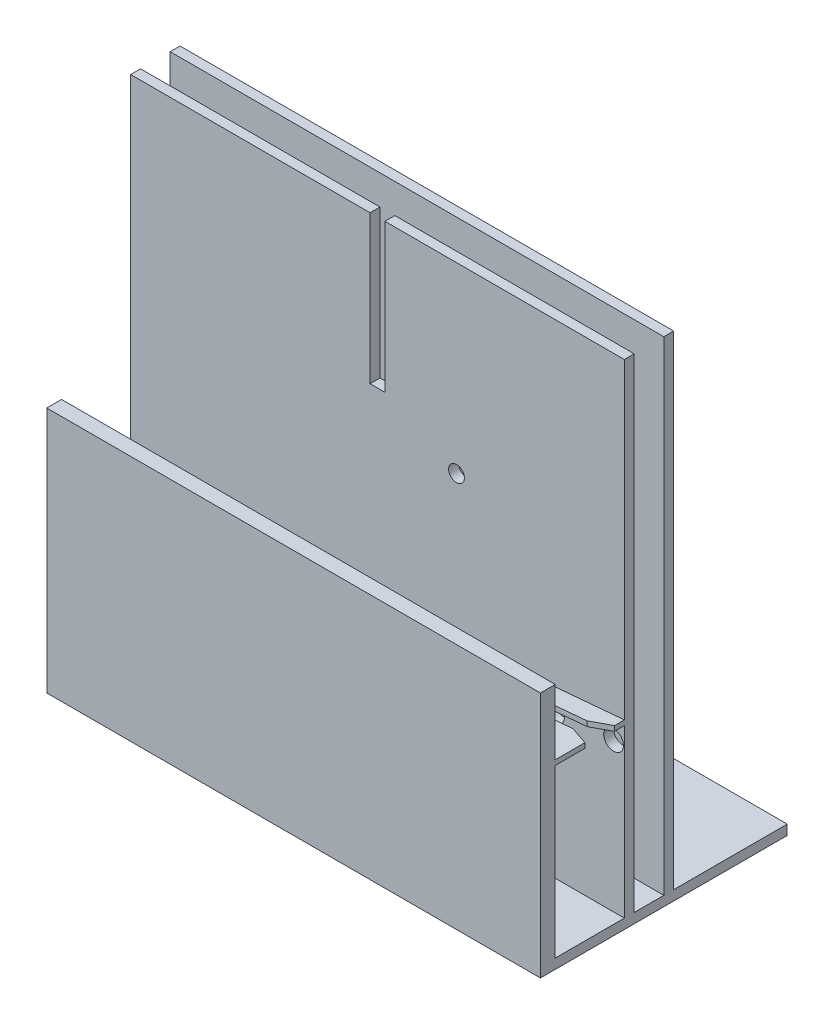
ISO-10303-21;
HEADER;
FILE_DESCRIPTION(('STEP AP214'),'2;1');
FILE_NAME('part.step','',(''),(''),'','','');
FILE_SCHEMA(('AUTOMOTIVE_DESIGN { 1 0 10303 214 1 1 1 1 }'));
ENDSEC;
DATA;
#1=APPLICATION_CONTEXT('core data for automotive mechanical design processes');
#2=APPLICATION_PROTOCOL_DEFINITION('international standard','automotive_design',2000,#1);
#3=PRODUCT_CONTEXT('',#1,'mechanical');
#4=PRODUCT('Part','Part','',(#3));
#5=PRODUCT_RELATED_PRODUCT_CATEGORY('part','',(#4));
#6=PRODUCT_DEFINITION_FORMATION('','',#4);
#7=PRODUCT_DEFINITION_CONTEXT('part definition',#1,'design');
#8=PRODUCT_DEFINITION('design','',#6,#7);
#9=PRODUCT_DEFINITION_SHAPE('','',#8);
#10=(LENGTH_UNIT() NAMED_UNIT(*) SI_UNIT(.MILLI.,.METRE.));
#11=(NAMED_UNIT(*) PLANE_ANGLE_UNIT() SI_UNIT($,.RADIAN.));
#12=(NAMED_UNIT(*) SI_UNIT($,.STERADIAN.) SOLID_ANGLE_UNIT());
#13=UNCERTAINTY_MEASURE_WITH_UNIT(LENGTH_MEASURE(1.E-05),#10,'distance_accuracy_value','');
#14=(GEOMETRIC_REPRESENTATION_CONTEXT(3) GLOBAL_UNCERTAINTY_ASSIGNED_CONTEXT((#13)) GLOBAL_UNIT_ASSIGNED_CONTEXT((#10,
#11,#12)) REPRESENTATION_CONTEXT('',''));
#15=CARTESIAN_POINT('',(0.,0.,0.));
#16=DIRECTION('',(0.,0.,1.));
#17=DIRECTION('',(1.,0.,0.));
#18=AXIS2_PLACEMENT_3D('',#15,#16,#17);
#19=CARTESIAN_POINT('',(249.999999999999,183.910364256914,500000.));
#20=DIRECTION('',(0.0871557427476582,-0.996194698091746,0.));
#21=DIRECTION('',(0.996194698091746,0.0871557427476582,0.));
#22=AXIS2_PLACEMENT_3D('',#19,#20,#21);
#23=PLANE('',#22);
#24=DIRECTION('',(0.924943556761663,0.0809220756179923,0.371390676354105));
#25=VECTOR('',#24,1.);
#26=CARTESIAN_POINT('',(230.076106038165,182.167249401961,72.));
#27=LINE('',#26,#25);
#28=CARTESIAN_POINT('',(230.076106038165,182.167249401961,72.));
#29=VERTEX_POINT('',#28);
#30=CARTESIAN_POINT('',(249.999999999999,183.910364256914,79.9999999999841));
#31=VERTEX_POINT('',#30);
#32=EDGE_CURVE('E226',#29,#31,#27,.T.);
#33=ORIENTED_EDGE('',*,*,#32,.F.);
#34=DIRECTION('',(0.996194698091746,0.0871557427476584,0.));
#35=VECTOR('',#34,1.);
#36=CARTESIAN_POINT('',(-0.436609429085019,162.,72.));
#37=LINE('',#36,#35);
#38=CARTESIAN_POINT('',(-0.436609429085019,162.,72.));
#39=VERTEX_POINT('',#38);
#40=EDGE_CURVE('E597',#39,#29,#37,.T.);
#41=ORIENTED_EDGE('',*,*,#40,.F.);
#42=DIRECTION('',(0.,0.,-1.));
#43=VECTOR('',#42,1.);
#44=CARTESIAN_POINT('',(-0.436609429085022,162.,500000.));
#45=LINE('',#44,#43);
#46=CARTESIAN_POINT('',(-0.436609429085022,162.,110.));
#47=VERTEX_POINT('',#46);
#48=EDGE_CURVE('E527',#47,#39,#45,.T.);
#49=ORIENTED_EDGE('',*,*,#48,.F.);
#50=DIRECTION('',(0.996194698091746,0.0871557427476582,0.));
#51=VECTOR('',#50,1.);
#52=CARTESIAN_POINT('',(249.999999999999,183.910364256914,110.000000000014));
#53=LINE('',#52,#51);
#54=CARTESIAN_POINT('',(250.,183.910364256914,110.));
#55=VERTEX_POINT('',#54);
#56=EDGE_CURVE('E581',#47,#55,#53,.T.);
#57=ORIENTED_EDGE('',*,*,#56,.T.);
#58=DIRECTION('',(0.,0.,-1.));
#59=VECTOR('',#58,1.);
#60=CARTESIAN_POINT('',(249.999999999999,183.910364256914,500000.));
#61=LINE('',#60,#59);
#62=EDGE_CURVE('E524',#55,#31,#61,.T.);
#63=ORIENTED_EDGE('',*,*,#62,.T.);
#64=EDGE_LOOP('',(#33,#41,#49,#57,#63));
#65=FACE_BOUND('',#64,.T.);
#66=ADVANCED_FACE('F33',(#65),#23,.F.);
#67=CARTESIAN_POINT('',(-250.,500.,110.));
#68=DIRECTION('',(0.,0.,-1.));
#69=DIRECTION('',(-1.,0.,0.));
#70=AXIS2_PLACEMENT_3D('',#67,#68,#69);
#71=PLANE('',#70);
#72=CARTESIAN_POINT('',(-110.,140.,110.));
#73=DIRECTION('',(0.,0.,-1.));
#74=DIRECTION('',(-1.,0.,0.));
#75=AXIS2_PLACEMENT_3D('',#72,#73,#74);
#76=CIRCLE('',#75,10.);
#77=CARTESIAN_POINT('',(-120.,140.,110.));
#78=VERTEX_POINT('',#77);
#79=EDGE_CURVE('E260',#78,#78,#76,.T.);
#80=ORIENTED_EDGE('',*,*,#79,.F.);
#81=EDGE_LOOP('',(#80));
#82=FACE_BOUND('',#81,.T.);
#83=CARTESIAN_POINT('',(-165.,140.,110.));
#84=DIRECTION('',(0.,0.,-1.));
#85=DIRECTION('',(-1.,0.,0.));
#86=AXIS2_PLACEMENT_3D('',#83,#84,#85);
#87=CIRCLE('',#86,10.);
#88=CARTESIAN_POINT('',(-175.,140.,110.));
#89=VERTEX_POINT('',#88);
#90=EDGE_CURVE('E266',#89,#89,#87,.T.);
#91=ORIENTED_EDGE('',*,*,#90,.F.);
#92=EDGE_LOOP('',(#91));
#93=FACE_BOUND('',#92,.T.);
#94=CARTESIAN_POINT('',(-220.,140.,110.));
#95=DIRECTION('',(0.,0.,-1.));
#96=DIRECTION('',(-1.,0.,0.));
#97=AXIS2_PLACEMENT_3D('',#94,#95,#96);
#98=CIRCLE('',#97,10.);
#99=CARTESIAN_POINT('',(-230.,140.,110.));
#100=VERTEX_POINT('',#99);
#101=EDGE_CURVE('E272',#100,#100,#98,.T.);
#102=ORIENTED_EDGE('',*,*,#101,.F.);
#103=EDGE_LOOP('',(#102));
#104=FACE_BOUND('',#103,.T.);
#105=CARTESIAN_POINT('',(-55.,140.,110.));
#106=DIRECTION('',(0.,0.,-1.));
#107=DIRECTION('',(-1.,0.,0.));
#108=AXIS2_PLACEMENT_3D('',#105,#106,#107);
#109=CIRCLE('',#108,10.);
#110=CARTESIAN_POINT('',(-65.,140.,110.));
#111=VERTEX_POINT('',#110);
#112=EDGE_CURVE('E259',#111,#111,#109,.T.);
#113=ORIENTED_EDGE('',*,*,#112,.F.);
#114=EDGE_LOOP('',(#113));
#115=FACE_BOUND('',#114,.T.);
#116=CARTESIAN_POINT('',(119.543363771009,150.458689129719,110.));
#117=DIRECTION('',(0.,0.,-1.));
#118=DIRECTION('',(-1.,0.,0.));
#119=AXIS2_PLACEMENT_3D('',#116,#117,#118);
#120=CIRCLE('',#119,10.);
#121=CARTESIAN_POINT('',(109.543363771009,150.458689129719,110.));
#122=VERTEX_POINT('',#121);
#123=EDGE_CURVE('E292',#122,#122,#120,.T.);
#124=ORIENTED_EDGE('',*,*,#123,.F.);
#125=EDGE_LOOP('',(#124));
#126=FACE_BOUND('',#125,.T.);
#127=CARTESIAN_POINT('',(179.315045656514,155.688033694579,110.));
#128=DIRECTION('',(0.,0.,-1.));
#129=DIRECTION('',(-1.,0.,0.));
#130=AXIS2_PLACEMENT_3D('',#127,#128,#129);
#131=CIRCLE('',#130,10.);
#132=CARTESIAN_POINT('',(169.315045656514,155.688033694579,110.));
#133=VERTEX_POINT('',#132);
#134=EDGE_CURVE('E298',#133,#133,#131,.T.);
#135=ORIENTED_EDGE('',*,*,#134,.F.);
#136=EDGE_LOOP('',(#135));
#137=FACE_BOUND('',#136,.T.);
#138=CARTESIAN_POINT('',(239.086727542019,160.917378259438,110.));
#139=DIRECTION('',(0.,0.,-1.));
#140=DIRECTION('',(-1.,0.,0.));
#141=AXIS2_PLACEMENT_3D('',#138,#139,#140);
#142=CIRCLE('',#141,10.);
#143=CARTESIAN_POINT('',(229.086727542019,160.917378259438,110.));
#144=VERTEX_POINT('',#143);
#145=EDGE_CURVE('E287',#144,#144,#142,.T.);
#146=ORIENTED_EDGE('',*,*,#145,.F.);
#147=EDGE_LOOP('',(#146));
#148=FACE_BOUND('',#147,.T.);
#149=CARTESIAN_POINT('',(59.7716818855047,145.22934456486,110.));
#150=DIRECTION('',(0.,0.,-1.));
#151=DIRECTION('',(-1.,0.,0.));
#152=AXIS2_PLACEMENT_3D('',#149,#150,#151);
#153=CIRCLE('',#152,10.);
#154=CARTESIAN_POINT('',(49.7716818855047,145.22934456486,110.));
#155=VERTEX_POINT('',#154);
#156=EDGE_CURVE('E291',#155,#155,#153,.T.);
#157=ORIENTED_EDGE('',*,*,#156,.F.);
#158=EDGE_LOOP('',(#157));
#159=FACE_BOUND('',#158,.T.);
#160=CARTESIAN_POINT('',(0.,140.,110.));
#161=DIRECTION('',(0.,0.,-1.));
#162=DIRECTION('',(-1.,0.,0.));
#163=AXIS2_PLACEMENT_3D('',#160,#161,#162);
#164=CIRCLE('',#163,10.);
#165=CARTESIAN_POINT('',(-10.,140.,110.));
#166=VERTEX_POINT('',#165);
#167=EDGE_CURVE('E317',#166,#166,#164,.T.);
#168=ORIENTED_EDGE('',*,*,#167,.F.);
#169=EDGE_LOOP('',(#168));
#170=FACE_BOUND('',#169,.T.);
#171=DIRECTION('',(0.,1.,0.));
#172=VECTOR('',#171,1.);
#173=CARTESIAN_POINT('',(-0.436609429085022,157.,110.000000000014));
#174=LINE('',#173,#172);
#175=CARTESIAN_POINT('',(-0.436609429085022,157.,110.));
#176=VERTEX_POINT('',#175);
#177=EDGE_CURVE('E57',#176,#47,#174,.T.);
#178=ORIENTED_EDGE('',*,*,#177,.F.);
#179=DIRECTION('',(-0.996194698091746,-0.0871557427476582,0.));
#180=VECTOR('',#179,1.);
#181=CARTESIAN_POINT('',(249.999999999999,178.910364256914,110.000000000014));
#182=LINE('',#181,#180);
#183=CARTESIAN_POINT('',(249.999999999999,178.910364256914,110.000000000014));
#184=VERTEX_POINT('',#183);
#185=EDGE_CURVE('E521',#184,#176,#182,.T.);
#186=ORIENTED_EDGE('',*,*,#185,.F.);
#187=DIRECTION('',(0.,-1.,0.));
#188=VECTOR('',#187,1.);
#189=CARTESIAN_POINT('',(250.,500.,110.));
#190=LINE('',#189,#188);
#191=CARTESIAN_POINT('',(250.,10.,110.));
#192=VERTEX_POINT('',#191);
#193=EDGE_CURVE('E245',#184,#192,#190,.T.);
#194=ORIENTED_EDGE('',*,*,#193,.T.);
#195=DIRECTION('',(1.,0.,0.));
#196=VECTOR('',#195,1.);
#197=CARTESIAN_POINT('',(-250.,10.,110.));
#198=LINE('',#197,#196);
#199=CARTESIAN_POINT('',(-250.,10.,110.));
#200=VERTEX_POINT('',#199);
#201=EDGE_CURVE('E427',#200,#192,#198,.T.);
#202=ORIENTED_EDGE('',*,*,#201,.F.);
#203=DIRECTION('',(0.,-1.,0.));
#204=VECTOR('',#203,1.);
#205=CARTESIAN_POINT('',(-250.,500.,110.));
#206=LINE('',#205,#204);
#207=CARTESIAN_POINT('',(-250.,250.,110.));
#208=VERTEX_POINT('',#207);
#209=EDGE_CURVE('E441',#208,#200,#206,.T.);
#210=ORIENTED_EDGE('',*,*,#209,.F.);
#211=DIRECTION('',(1.,0.,0.));
#212=VECTOR('',#211,1.);
#213=CARTESIAN_POINT('',(-250.000000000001,250.,110.));
#214=LINE('',#213,#212);
#215=CARTESIAN_POINT('',(250.,250.,110.));
#216=VERTEX_POINT('',#215);
#217=EDGE_CURVE('E330',#208,#216,#214,.T.);
#218=ORIENTED_EDGE('',*,*,#217,.T.);
#219=EDGE_CURVE('E439',#216,#55,#190,.T.);
#220=ORIENTED_EDGE('',*,*,#219,.T.);
#221=ORIENTED_EDGE('',*,*,#56,.F.);
#222=EDGE_LOOP('',(#178,#186,#194,#202,#210,#218,#220,#221));
#223=FACE_BOUND('',#222,.T.);
#224=ADVANCED_FACE('F507',(#82,#93,#104,#115,#126,#137,#148,#159,#170,#223),#71,.T.);
#225=CARTESIAN_POINT('',(0.,0.,40.));
#226=DIRECTION('',(0.,0.,1.));
#227=DIRECTION('',(1.,0.,0.));
#228=AXIS2_PLACEMENT_3D('',#225,#226,#227);
#229=PLANE('',#228);
#230=CARTESIAN_POINT('',(80.,315.,40.));
#231=DIRECTION('',(0.,0.,1.));
#232=DIRECTION('',(1.,0.,0.));
#233=AXIS2_PLACEMENT_3D('',#230,#231,#232);
#234=CIRCLE('',#233,8.00000000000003);
#235=CARTESIAN_POINT('',(88.,315.,40.));
#236=VERTEX_POINT('',#235);
#237=EDGE_CURVE('E609',#236,#236,#234,.T.);
#238=ORIENTED_EDGE('',*,*,#237,.F.);
#239=EDGE_LOOP('',(#238));
#240=FACE_BOUND('',#239,.T.);
#241=CARTESIAN_POINT('',(-55.,140.,40.));
#242=DIRECTION('',(0.,0.,1.));
#243=DIRECTION('',(1.,0.,0.));
#244=AXIS2_PLACEMENT_3D('',#241,#242,#243);
#245=CIRCLE('',#244,10.);
#246=CARTESIAN_POINT('',(-45.,140.,40.));
#247=VERTEX_POINT('',#246);
#248=EDGE_CURVE('E279',#247,#247,#245,.T.);
#249=ORIENTED_EDGE('',*,*,#248,.F.);
#250=EDGE_LOOP('',(#249));
#251=FACE_BOUND('',#250,.T.);
#252=CARTESIAN_POINT('',(59.7716818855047,145.22934456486,40.));
#253=DIRECTION('',(0.,0.,1.));
#254=DIRECTION('',(1.,0.,0.));
#255=AXIS2_PLACEMENT_3D('',#252,#253,#254);
#256=CIRCLE('',#255,10.);
#257=CARTESIAN_POINT('',(69.7716818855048,145.22934456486,40.));
#258=VERTEX_POINT('',#257);
#259=EDGE_CURVE('E309',#258,#258,#256,.T.);
#260=ORIENTED_EDGE('',*,*,#259,.F.);
#261=EDGE_LOOP('',(#260));
#262=FACE_BOUND('',#261,.T.);
#263=CARTESIAN_POINT('',(0.,140.,40.));
#264=DIRECTION('',(0.,0.,1.));
#265=DIRECTION('',(1.,0.,0.));
#266=AXIS2_PLACEMENT_3D('',#263,#264,#265);
#267=CIRCLE('',#266,10.);
#268=CARTESIAN_POINT('',(10.,140.,40.));
#269=VERTEX_POINT('',#268);
#270=EDGE_CURVE('E321',#269,#269,#267,.T.);
#271=ORIENTED_EDGE('',*,*,#270,.F.);
#272=EDGE_LOOP('',(#271));
#273=FACE_BOUND('',#272,.T.);
#274=CARTESIAN_POINT('',(119.543363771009,150.458689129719,40.));
#275=DIRECTION('',(0.,0.,1.));
#276=DIRECTION('',(1.,0.,0.));
#277=AXIS2_PLACEMENT_3D('',#274,#275,#276);
#278=CIRCLE('',#277,10.);
#279=CARTESIAN_POINT('',(129.543363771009,150.458689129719,40.));
#280=VERTEX_POINT('',#279);
#281=EDGE_CURVE('E468',#280,#280,#278,.T.);
#282=ORIENTED_EDGE('',*,*,#281,.F.);
#283=EDGE_LOOP('',(#282));
#284=FACE_BOUND('',#283,.T.);
#285=CARTESIAN_POINT('',(179.315045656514,155.688033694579,40.));
#286=DIRECTION('',(0.,0.,1.));
#287=DIRECTION('',(1.,0.,0.));
#288=AXIS2_PLACEMENT_3D('',#285,#286,#287);
#289=CIRCLE('',#288,10.);
#290=CARTESIAN_POINT('',(189.315045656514,155.688033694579,40.));
#291=VERTEX_POINT('',#290);
#292=EDGE_CURVE('E474',#291,#291,#289,.T.);
#293=ORIENTED_EDGE('',*,*,#292,.F.);
#294=EDGE_LOOP('',(#293));
#295=FACE_BOUND('',#294,.T.);
#296=CARTESIAN_POINT('',(239.086727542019,160.917378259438,40.));
#297=DIRECTION('',(0.,0.,1.));
#298=DIRECTION('',(1.,0.,0.));
#299=AXIS2_PLACEMENT_3D('',#296,#297,#298);
#300=CIRCLE('',#299,10.);
#301=CARTESIAN_POINT('',(249.086727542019,160.917378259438,40.));
#302=VERTEX_POINT('',#301);
#303=EDGE_CURVE('E480',#302,#302,#300,.T.);
#304=ORIENTED_EDGE('',*,*,#303,.F.);
#305=EDGE_LOOP('',(#304));
#306=FACE_BOUND('',#305,.T.);
#307=CARTESIAN_POINT('',(-110.,140.,40.));
#308=DIRECTION('',(0.,0.,1.));
#309=DIRECTION('',(1.,0.,0.));
#310=AXIS2_PLACEMENT_3D('',#307,#308,#309);
#311=CIRCLE('',#310,10.);
#312=CARTESIAN_POINT('',(-100.,140.,40.));
#313=VERTEX_POINT('',#312);
#314=EDGE_CURVE('E486',#313,#313,#311,.T.);
#315=ORIENTED_EDGE('',*,*,#314,.F.);
#316=EDGE_LOOP('',(#315));
#317=FACE_BOUND('',#316,.T.);
#318=CARTESIAN_POINT('',(-165.,140.,40.));
#319=DIRECTION('',(0.,0.,1.));
#320=DIRECTION('',(1.,0.,0.));
#321=AXIS2_PLACEMENT_3D('',#318,#319,#320);
#322=CIRCLE('',#321,10.);
#323=CARTESIAN_POINT('',(-155.,140.,40.));
#324=VERTEX_POINT('',#323);
#325=EDGE_CURVE('E492',#324,#324,#322,.T.);
#326=ORIENTED_EDGE('',*,*,#325,.F.);
#327=EDGE_LOOP('',(#326));
#328=FACE_BOUND('',#327,.T.);
#329=CARTESIAN_POINT('',(-220.,140.,40.));
#330=DIRECTION('',(0.,0.,1.));
#331=DIRECTION('',(1.,0.,0.));
#332=AXIS2_PLACEMENT_3D('',#329,#330,#331);
#333=CIRCLE('',#332,10.);
#334=CARTESIAN_POINT('',(-210.,140.,40.));
#335=VERTEX_POINT('',#334);
#336=EDGE_CURVE('E42',#335,#335,#333,.T.);
#337=ORIENTED_EDGE('',*,*,#336,.F.);
#338=EDGE_LOOP('',(#337));
#339=FACE_BOUND('',#338,.T.);
#340=DIRECTION('',(0.,1.,0.));
#341=VECTOR('',#340,1.);
#342=CARTESIAN_POINT('',(249.999999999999,10.,40.));
#343=LINE('',#342,#341);
#344=CARTESIAN_POINT('',(249.999999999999,10.,40.));
#345=VERTEX_POINT('',#344);
#346=CARTESIAN_POINT('',(249.999999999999,178.910364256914,40.));
#347=VERTEX_POINT('',#346);
#348=EDGE_CURVE('E385',#345,#347,#343,.T.);
#349=ORIENTED_EDGE('',*,*,#348,.T.);
#350=DIRECTION('',(0.996194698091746,0.0871557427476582,0.));
#351=VECTOR('',#350,1.);
#352=CARTESIAN_POINT('',(249.999999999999,178.910364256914,40.));
#353=LINE('',#352,#351);
#354=CARTESIAN_POINT('',(-0.436609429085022,157.,40.));
#355=VERTEX_POINT('',#354);
#356=EDGE_CURVE('E275',#355,#347,#353,.T.);
#357=ORIENTED_EDGE('',*,*,#356,.F.);
#358=DIRECTION('',(0.,-1.,0.));
#359=VECTOR('',#358,1.);
#360=CARTESIAN_POINT('',(-0.436609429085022,157.,40.));
#361=LINE('',#360,#359);
#362=CARTESIAN_POINT('',(-0.436609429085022,162.,40.));
#363=VERTEX_POINT('',#362);
#364=EDGE_CURVE('E250',#363,#355,#361,.T.);
#365=ORIENTED_EDGE('',*,*,#364,.F.);
#366=DIRECTION('',(-0.996194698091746,-0.0871557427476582,0.));
#367=VECTOR('',#366,1.);
#368=CARTESIAN_POINT('',(249.999999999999,183.910364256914,40.));
#369=LINE('',#368,#367);
#370=CARTESIAN_POINT('',(249.999999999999,183.910364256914,40.));
#371=VERTEX_POINT('',#370);
#372=EDGE_CURVE('E246',#371,#363,#369,.T.);
#373=ORIENTED_EDGE('',*,*,#372,.F.);
#374=CARTESIAN_POINT('',(250.,500.,40.));
#375=VERTEX_POINT('',#374);
#376=EDGE_CURVE('E384',#371,#375,#343,.T.);
#377=ORIENTED_EDGE('',*,*,#376,.T.);
#378=DIRECTION('',(-1.,0.,0.));
#379=VECTOR('',#378,1.);
#380=CARTESIAN_POINT('',(250.,500.,40.));
#381=LINE('',#380,#379);
#382=CARTESIAN_POINT('',(7.5,500.,40.));
#383=VERTEX_POINT('',#382);
#384=EDGE_CURVE('E369',#375,#383,#381,.T.);
#385=ORIENTED_EDGE('',*,*,#384,.T.);
#386=DIRECTION('',(0.,1.,0.));
#387=VECTOR('',#386,1.);
#388=CARTESIAN_POINT('',(7.5,500.,40.));
#389=LINE('',#388,#387);
#390=CARTESIAN_POINT('',(7.49999999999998,350.,40.));
#391=VERTEX_POINT('',#390);
#392=EDGE_CURVE('E350',#391,#383,#389,.T.);
#393=ORIENTED_EDGE('',*,*,#392,.F.);
#394=DIRECTION('',(1.,0.,0.));
#395=VECTOR('',#394,1.);
#396=CARTESIAN_POINT('',(-7.49999999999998,350.,40.));
#397=LINE('',#396,#395);
#398=CARTESIAN_POINT('',(-7.49999999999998,350.,40.));
#399=VERTEX_POINT('',#398);
#400=EDGE_CURVE('E347',#399,#391,#397,.T.);
#401=ORIENTED_EDGE('',*,*,#400,.F.);
#402=DIRECTION('',(0.,-1.,0.));
#403=VECTOR('',#402,1.);
#404=CARTESIAN_POINT('',(-7.5,500.,40.));
#405=LINE('',#404,#403);
#406=CARTESIAN_POINT('',(-7.50000000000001,500.,40.));
#407=VERTEX_POINT('',#406);
#408=EDGE_CURVE('E344',#407,#399,#405,.T.);
#409=ORIENTED_EDGE('',*,*,#408,.F.);
#410=CARTESIAN_POINT('',(-250.000000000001,500.,40.));
#411=VERTEX_POINT('',#410);
#412=EDGE_CURVE('E388',#407,#411,#381,.T.);
#413=ORIENTED_EDGE('',*,*,#412,.T.);
#414=DIRECTION('',(0.,-1.,0.));
#415=VECTOR('',#414,1.);
#416=CARTESIAN_POINT('',(-250.000000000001,500.,40.));
#417=LINE('',#416,#415);
#418=CARTESIAN_POINT('',(-250.000000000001,10.,40.));
#419=VERTEX_POINT('',#418);
#420=EDGE_CURVE('E364',#411,#419,#417,.T.);
#421=ORIENTED_EDGE('',*,*,#420,.T.);
#422=DIRECTION('',(1.,0.,0.));
#423=VECTOR('',#422,1.);
#424=CARTESIAN_POINT('',(-250.000000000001,10.,40.));
#425=LINE('',#424,#423);
#426=EDGE_CURVE('E381',#419,#345,#425,.T.);
#427=ORIENTED_EDGE('',*,*,#426,.T.);
#428=EDGE_LOOP('',(#349,#357,#365,#373,#377,#385,#393,#401,#409,#413,#421,#427));
#429=FACE_BOUND('',#428,.T.);
#430=ADVANCED_FACE('F503',(#240,#251,#262,#273,#284,#295,#306,#317,#328,#339,#429),#229,.T.);
#431=CARTESIAN_POINT('',(250.,500.,30.));
#432=DIRECTION('',(0.,1.,0.));
#433=DIRECTION('',(0.,0.,1.));
#434=AXIS2_PLACEMENT_3D('',#431,#432,#433);
#435=PLANE('',#434);
#436=DIRECTION('',(0.,0.,1.));
#437=VECTOR('',#436,1.);
#438=CARTESIAN_POINT('',(7.5,500.,-125.001));
#439=LINE('',#438,#437);
#440=CARTESIAN_POINT('',(7.5,500.,30.));
#441=VERTEX_POINT('',#440);
#442=EDGE_CURVE('E356',#441,#383,#439,.T.);
#443=ORIENTED_EDGE('',*,*,#442,.T.);
#444=ORIENTED_EDGE('',*,*,#384,.F.);
#445=DIRECTION('',(0.,0.,1.));
#446=VECTOR('',#445,1.);
#447=CARTESIAN_POINT('',(250.,500.,30.));
#448=LINE('',#447,#446);
#449=CARTESIAN_POINT('',(250.,500.,30.));
#450=VERTEX_POINT('',#449);
#451=EDGE_CURVE('E378',#450,#375,#448,.T.);
#452=ORIENTED_EDGE('',*,*,#451,.F.);
#453=DIRECTION('',(-1.,0.,0.));
#454=VECTOR('',#453,1.);
#455=CARTESIAN_POINT('',(250.,500.,30.));
#456=LINE('',#455,#454);
#457=EDGE_CURVE('E375',#450,#441,#456,.T.);
#458=ORIENTED_EDGE('',*,*,#457,.T.);
#459=EDGE_LOOP('',(#443,#444,#452,#458));
#460=FACE_BOUND('',#459,.T.);
#461=ADVANCED_FACE('F506',(#460),#435,.T.);
#462=CARTESIAN_POINT('',(0.,10.,0.));
#463=DIRECTION('',(0.,1.,0.));
#464=DIRECTION('',(0.,0.,1.));
#465=AXIS2_PLACEMENT_3D('',#462,#463,#464);
#466=PLANE('',#465);
#467=DIRECTION('',(0.,0.,1.));
#468=VECTOR('',#467,1.);
#469=CARTESIAN_POINT('',(-250.000000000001,10.,0.));
#470=LINE('',#469,#468);
#471=CARTESIAN_POINT('',(-250.000000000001,10.,0.));
#472=VERTEX_POINT('',#471);
#473=CARTESIAN_POINT('',(-250.000000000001,10.,30.));
#474=VERTEX_POINT('',#473);
#475=EDGE_CURVE('E425',#472,#474,#470,.T.);
#476=ORIENTED_EDGE('',*,*,#475,.T.);
#477=DIRECTION('',(1.,0.,0.));
#478=VECTOR('',#477,1.);
#479=CARTESIAN_POINT('',(-250.000000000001,10.,30.));
#480=LINE('',#479,#478);
#481=CARTESIAN_POINT('',(249.999999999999,10.,30.));
#482=VERTEX_POINT('',#481);
#483=EDGE_CURVE('E368',#474,#482,#480,.T.);
#484=ORIENTED_EDGE('',*,*,#483,.T.);
#485=DIRECTION('',(0.,0.,-1.));
#486=VECTOR('',#485,1.);
#487=CARTESIAN_POINT('',(249.999999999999,10.,0.));
#488=LINE('',#487,#486);
#489=CARTESIAN_POINT('',(249.999999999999,10.,0.));
#490=VERTEX_POINT('',#489);
#491=EDGE_CURVE('E430',#482,#490,#488,.T.);
#492=ORIENTED_EDGE('',*,*,#491,.T.);
#493=DIRECTION('',(-1.,0.,0.));
#494=VECTOR('',#493,1.);
#495=CARTESIAN_POINT('',(-250.000000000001,10.,0.));
#496=LINE('',#495,#494);
#497=EDGE_CURVE('E424',#490,#472,#496,.T.);
#498=ORIENTED_EDGE('',*,*,#497,.T.);
#499=EDGE_LOOP('',(#476,#484,#492,#498));
#500=FACE_BOUND('',#499,.T.);
#501=ADVANCED_FACE('F770',(#500),#466,.T.);
#502=CARTESIAN_POINT('',(-250.,500.,-125.));
#503=DIRECTION('',(1.,0.,0.));
#504=DIRECTION('',(0.,0.,-1.));
#505=AXIS2_PLACEMENT_3D('',#502,#503,#504);
#506=PLANE('',#505);
#507=DIRECTION('',(0.,-1.,0.));
#508=VECTOR('',#507,1.);
#509=CARTESIAN_POINT('',(-250.,500.,125.));
#510=LINE('',#509,#508);
#511=CARTESIAN_POINT('',(-250.000000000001,250.,125.));
#512=VERTEX_POINT('',#511);
#513=CARTESIAN_POINT('',(-250.,0.,125.));
#514=VERTEX_POINT('',#513);
#515=EDGE_CURVE('E466',#512,#514,#510,.T.);
#516=ORIENTED_EDGE('',*,*,#515,.F.);
#517=DIRECTION('',(0.,0.,1.));
#518=VECTOR('',#517,1.);
#519=CARTESIAN_POINT('',(-250.000000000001,250.,-125.001));
#520=LINE('',#519,#518);
#521=EDGE_CURVE('E329',#208,#512,#520,.T.);
#522=ORIENTED_EDGE('',*,*,#521,.F.);
#523=ORIENTED_EDGE('',*,*,#209,.T.);
#524=EDGE_CURVE('E419',#419,#200,#470,.T.);
#525=ORIENTED_EDGE('',*,*,#524,.F.);
#526=ORIENTED_EDGE('',*,*,#420,.F.);
#527=DIRECTION('',(0.,0.,1.));
#528=VECTOR('',#527,1.);
#529=CARTESIAN_POINT('',(-250.000000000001,500.,30.));
#530=LINE('',#529,#528);
#531=CARTESIAN_POINT('',(-250.000000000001,500.,30.));
#532=VERTEX_POINT('',#531);
#533=EDGE_CURVE('E391',#532,#411,#530,.T.);
#534=ORIENTED_EDGE('',*,*,#533,.F.);
#535=DIRECTION('',(0.,-1.,0.));
#536=VECTOR('',#535,1.);
#537=CARTESIAN_POINT('',(-250.000000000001,500.,30.));
#538=LINE('',#537,#536);
#539=EDGE_CURVE('E365',#532,#474,#538,.T.);
#540=ORIENTED_EDGE('',*,*,#539,.T.);
#541=ORIENTED_EDGE('',*,*,#475,.F.);
#542=DIRECTION('',(0.,-1.,0.));
#543=VECTOR('',#542,1.);
#544=CARTESIAN_POINT('',(-250.000000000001,500.,0.));
#545=LINE('',#544,#543);
#546=CARTESIAN_POINT('',(-250.000000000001,500.,0.));
#547=VERTEX_POINT('',#546);
#548=EDGE_CURVE('E423',#547,#472,#545,.T.);
#549=ORIENTED_EDGE('',*,*,#548,.F.);
#550=DIRECTION('',(0.,0.,1.));
#551=VECTOR('',#550,1.);
#552=CARTESIAN_POINT('',(-250.,500.,-125.));
#553=LINE('',#552,#551);
#554=CARTESIAN_POINT('',(-250.000000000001,500.,-9.99999999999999));
#555=VERTEX_POINT('',#554);
#556=EDGE_CURVE('E444',#555,#547,#553,.T.);
#557=ORIENTED_EDGE('',*,*,#556,.F.);
#558=DIRECTION('',(0.,-1.,0.));
#559=VECTOR('',#558,1.);
#560=CARTESIAN_POINT('',(-250.000000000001,500.,-9.99999999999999));
#561=LINE('',#560,#559);
#562=CARTESIAN_POINT('',(-250.000000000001,10.,-9.99999999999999));
#563=VERTEX_POINT('',#562);
#564=EDGE_CURVE('E416',#555,#563,#561,.T.);
#565=ORIENTED_EDGE('',*,*,#564,.T.);
#566=DIRECTION('',(0.,0.,1.));
#567=VECTOR('',#566,1.);
#568=CARTESIAN_POINT('',(-250.,10.,-125.));
#569=LINE('',#568,#567);
#570=CARTESIAN_POINT('',(-250.,10.,-125.));
#571=VERTEX_POINT('',#570);
#572=EDGE_CURVE('E400',#571,#563,#569,.T.);
#573=ORIENTED_EDGE('',*,*,#572,.F.);
#574=DIRECTION('',(0.,-1.,0.));
#575=VECTOR('',#574,1.);
#576=CARTESIAN_POINT('',(-250.,500.,-125.));
#577=LINE('',#576,#575);
#578=CARTESIAN_POINT('',(-250.,0.,-125.));
#579=VERTEX_POINT('',#578);
#580=EDGE_CURVE('E450',#571,#579,#577,.T.);
#581=ORIENTED_EDGE('',*,*,#580,.T.);
#582=DIRECTION('',(0.,0.,1.));
#583=VECTOR('',#582,1.);
#584=CARTESIAN_POINT('',(-250.,0.,-125.));
#585=LINE('',#584,#583);
#586=EDGE_CURVE('E443',#579,#514,#585,.T.);
#587=ORIENTED_EDGE('',*,*,#586,.T.);
#588=EDGE_LOOP('',(#516,#522,#523,#525,#526,#534,#540,#541,#549,#557,#565,#573,#581,#587));
#589=FACE_BOUND('',#588,.T.);
#590=ADVANCED_FACE('F574',(#589),#506,.F.);
#591=CARTESIAN_POINT('',(250.,500.,-125.));
#592=DIRECTION('',(-1.,0.,0.));
#593=DIRECTION('',(0.,0.,1.));
#594=AXIS2_PLACEMENT_3D('',#591,#592,#593);
#595=PLANE('',#594);
#596=DIRECTION('',(0.,0.,-1.));
#597=VECTOR('',#596,1.);
#598=CARTESIAN_POINT('',(249.999999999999,178.910364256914,500000.));
#599=LINE('',#598,#597);
#600=CARTESIAN_POINT('',(250.000000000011,178.910364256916,79.8256885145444));
#601=VERTEX_POINT('',#600);
#602=EDGE_CURVE('E238',#184,#601,#599,.T.);
#603=ORIENTED_EDGE('',*,*,#602,.T.);
#604=DIRECTION('',(0.,-0.999392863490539,-0.034841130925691));
#605=VECTOR('',#604,1.);
#606=CARTESIAN_POINT('',(250.,-0.402077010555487,73.5744449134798));
#607=LINE('',#606,#605);
#608=EDGE_CURVE('E220',#31,#601,#607,.T.);
#609=ORIENTED_EDGE('',*,*,#608,.F.);
#610=ORIENTED_EDGE('',*,*,#62,.F.);
#611=ORIENTED_EDGE('',*,*,#219,.F.);
#612=DIRECTION('',(0.,0.,1.));
#613=VECTOR('',#612,1.);
#614=CARTESIAN_POINT('',(249.999999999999,250.,-125.001));
#615=LINE('',#614,#613);
#616=CARTESIAN_POINT('',(249.999999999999,250.,125.));
#617=VERTEX_POINT('',#616);
#618=EDGE_CURVE('E333',#216,#617,#615,.T.);
#619=ORIENTED_EDGE('',*,*,#618,.T.);
#620=DIRECTION('',(0.,-1.,0.));
#621=VECTOR('',#620,1.);
#622=CARTESIAN_POINT('',(250.,500.,125.));
#623=LINE('',#622,#621);
#624=CARTESIAN_POINT('',(250.,0.,125.));
#625=VERTEX_POINT('',#624);
#626=EDGE_CURVE('E464',#617,#625,#623,.T.);
#627=ORIENTED_EDGE('',*,*,#626,.T.);
#628=DIRECTION('',(0.,0.,-1.));
#629=VECTOR('',#628,1.);
#630=CARTESIAN_POINT('',(250.,0.,-125.));
#631=LINE('',#630,#629);
#632=CARTESIAN_POINT('',(250.,0.,-125.));
#633=VERTEX_POINT('',#632);
#634=EDGE_CURVE('E456',#625,#633,#631,.T.);
#635=ORIENTED_EDGE('',*,*,#634,.T.);
#636=DIRECTION('',(0.,-1.,0.));
#637=VECTOR('',#636,1.);
#638=CARTESIAN_POINT('',(250.,500.,-125.));
#639=LINE('',#638,#637);
#640=CARTESIAN_POINT('',(250.,10.,-125.));
#641=VERTEX_POINT('',#640);
#642=EDGE_CURVE('E462',#641,#633,#639,.T.);
#643=ORIENTED_EDGE('',*,*,#642,.F.);
#644=DIRECTION('',(0.,0.,-1.));
#645=VECTOR('',#644,1.);
#646=CARTESIAN_POINT('',(250.,10.,-125.));
#647=LINE('',#646,#645);
#648=CARTESIAN_POINT('',(249.999999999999,10.,-9.99999999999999));
#649=VERTEX_POINT('',#648);
#650=EDGE_CURVE('E411',#649,#641,#647,.T.);
#651=ORIENTED_EDGE('',*,*,#650,.F.);
#652=DIRECTION('',(0.,-1.,0.));
#653=VECTOR('',#652,1.);
#654=CARTESIAN_POINT('',(249.999999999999,500.,-9.99999999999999));
#655=LINE('',#654,#653);
#656=CARTESIAN_POINT('',(249.999999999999,500.,-9.99999999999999));
#657=VERTEX_POINT('',#656);
#658=EDGE_CURVE('E405',#657,#649,#655,.T.);
#659=ORIENTED_EDGE('',*,*,#658,.F.);
#660=DIRECTION('',(0.,0.,-1.));
#661=VECTOR('',#660,1.);
#662=CARTESIAN_POINT('',(250.,500.,-125.));
#663=LINE('',#662,#661);
#664=CARTESIAN_POINT('',(250.,500.,0.));
#665=VERTEX_POINT('',#664);
#666=EDGE_CURVE('E446',#665,#657,#663,.T.);
#667=ORIENTED_EDGE('',*,*,#666,.F.);
#668=DIRECTION('',(0.,-1.,0.));
#669=VECTOR('',#668,1.);
#670=CARTESIAN_POINT('',(249.999999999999,500.,0.));
#671=LINE('',#670,#669);
#672=EDGE_CURVE('E436',#665,#490,#671,.T.);
#673=ORIENTED_EDGE('',*,*,#672,.T.);
#674=ORIENTED_EDGE('',*,*,#491,.F.);
#675=DIRECTION('',(0.,1.,0.));
#676=VECTOR('',#675,1.);
#677=CARTESIAN_POINT('',(249.999999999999,10.,30.));
#678=LINE('',#677,#676);
#679=EDGE_CURVE('E371',#482,#450,#678,.T.);
#680=ORIENTED_EDGE('',*,*,#679,.T.);
#681=ORIENTED_EDGE('',*,*,#451,.T.);
#682=ORIENTED_EDGE('',*,*,#376,.F.);
#683=CARTESIAN_POINT('',(250.,183.910364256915,50.));
#684=VERTEX_POINT('',#683);
#685=EDGE_CURVE('E526',#684,#371,#61,.T.);
#686=ORIENTED_EDGE('',*,*,#685,.F.);
#687=DIRECTION('',(0.,0.999392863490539,-0.034841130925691));
#688=VECTOR('',#687,1.);
#689=CARTESIAN_POINT('',(250.,1.61748169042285,56.3551486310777));
#690=LINE('',#689,#688);
#691=CARTESIAN_POINT('',(249.999999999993,178.910364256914,50.1743114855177));
#692=VERTEX_POINT('',#691);
#693=EDGE_CURVE('E231',#692,#684,#690,.T.);
#694=ORIENTED_EDGE('',*,*,#693,.F.);
#695=EDGE_CURVE('E247',#692,#347,#599,.T.);
#696=ORIENTED_EDGE('',*,*,#695,.T.);
#697=ORIENTED_EDGE('',*,*,#348,.F.);
#698=EDGE_CURVE('E431',#192,#345,#488,.T.);
#699=ORIENTED_EDGE('',*,*,#698,.F.);
#700=ORIENTED_EDGE('',*,*,#193,.F.);
#701=EDGE_LOOP('',(#603,#609,#610,#611,#619,#627,#635,#643,#651,#659,#667,#673,#674,#680,#681,
#682,#686,#694,#696,#697,#699,#700));
#702=FACE_BOUND('',#701,.T.);
#703=ADVANCED_FACE('F243',(#702),#595,.F.);
#704=CARTESIAN_POINT('',(0.,500.,0.));
#705=DIRECTION('',(0.,1.,0.));
#706=DIRECTION('',(0.,0.,1.));
#707=AXIS2_PLACEMENT_3D('',#704,#705,#706);
#708=PLANE('',#707);
#709=ORIENTED_EDGE('',*,*,#666,.T.);
#710=DIRECTION('',(1.,0.,0.));
#711=VECTOR('',#710,1.);
#712=CARTESIAN_POINT('',(-250.000000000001,500.,-9.99999999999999));
#713=LINE('',#712,#711);
#714=EDGE_CURVE('E403',#555,#657,#713,.T.);
#715=ORIENTED_EDGE('',*,*,#714,.F.);
#716=ORIENTED_EDGE('',*,*,#556,.T.);
#717=DIRECTION('',(-1.,0.,0.));
#718=VECTOR('',#717,1.);
#719=CARTESIAN_POINT('',(-250.000000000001,500.,0.));
#720=LINE('',#719,#718);
#721=EDGE_CURVE('E420',#665,#547,#720,.T.);
#722=ORIENTED_EDGE('',*,*,#721,.F.);
#723=EDGE_LOOP('',(#709,#715,#716,#722));
#724=FACE_BOUND('',#723,.T.);
#725=ADVANCED_FACE('F775',(#724),#708,.T.);
#726=CARTESIAN_POINT('',(-250.,500.,-125.));
#727=DIRECTION('',(0.,0.,1.));
#728=DIRECTION('',(1.,0.,0.));
#729=AXIS2_PLACEMENT_3D('',#726,#727,#728);
#730=PLANE('',#729);
#731=DIRECTION('',(-1.,0.,0.));
#732=VECTOR('',#731,1.);
#733=CARTESIAN_POINT('',(-250.,10.,-125.));
#734=LINE('',#733,#732);
#735=EDGE_CURVE('E406',#641,#571,#734,.T.);
#736=ORIENTED_EDGE('',*,*,#735,.F.);
#737=ORIENTED_EDGE('',*,*,#642,.T.);
#738=DIRECTION('',(-1.,0.,0.));
#739=VECTOR('',#738,1.);
#740=CARTESIAN_POINT('',(-250.,0.,-125.));
#741=LINE('',#740,#739);
#742=EDGE_CURVE('E447',#633,#579,#741,.T.);
#743=ORIENTED_EDGE('',*,*,#742,.T.);
#744=ORIENTED_EDGE('',*,*,#580,.F.);
#745=EDGE_LOOP('',(#736,#737,#743,#744));
#746=FACE_BOUND('',#745,.T.);
#747=ADVANCED_FACE('F778',(#746),#730,.F.);
#748=CARTESIAN_POINT('',(-250.,500.,125.));
#749=DIRECTION('',(0.,0.,-1.));
#750=DIRECTION('',(-1.,0.,0.));
#751=AXIS2_PLACEMENT_3D('',#748,#749,#750);
#752=PLANE('',#751);
#753=ORIENTED_EDGE('',*,*,#626,.F.);
#754=DIRECTION('',(1.,0.,0.));
#755=VECTOR('',#754,1.);
#756=CARTESIAN_POINT('',(-250.000000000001,250.,125.));
#757=LINE('',#756,#755);
#758=EDGE_CURVE('E334',#512,#617,#757,.T.);
#759=ORIENTED_EDGE('',*,*,#758,.F.);
#760=ORIENTED_EDGE('',*,*,#515,.T.);
#761=DIRECTION('',(1.,0.,0.));
#762=VECTOR('',#761,1.);
#763=CARTESIAN_POINT('',(-250.,0.,125.));
#764=LINE('',#763,#762);
#765=EDGE_CURVE('E453',#514,#625,#764,.T.);
#766=ORIENTED_EDGE('',*,*,#765,.T.);
#767=EDGE_LOOP('',(#753,#759,#760,#766));
#768=FACE_BOUND('',#767,.T.);
#769=ADVANCED_FACE('F782',(#768),#752,.F.);
#770=CARTESIAN_POINT('',(0.,0.,0.));
#771=DIRECTION('',(0.,1.,0.));
#772=DIRECTION('',(0.,0.,1.));
#773=AXIS2_PLACEMENT_3D('',#770,#771,#772);
#774=PLANE('',#773);
#775=ORIENTED_EDGE('',*,*,#586,.F.);
#776=ORIENTED_EDGE('',*,*,#742,.F.);
#777=ORIENTED_EDGE('',*,*,#634,.F.);
#778=ORIENTED_EDGE('',*,*,#765,.F.);
#779=EDGE_LOOP('',(#775,#776,#777,#778));
#780=FACE_BOUND('',#779,.T.);
#781=ADVANCED_FACE('F772',(#780),#774,.F.);
#782=CARTESIAN_POINT('',(-250.000000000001,500.,0.));
#783=DIRECTION('',(0.,0.,1.));
#784=DIRECTION('',(1.,0.,0.));
#785=AXIS2_PLACEMENT_3D('',#782,#783,#784);
#786=PLANE('',#785);
#787=CARTESIAN_POINT('',(80.,315.,0.));
#788=DIRECTION('',(0.,0.,1.));
#789=DIRECTION('',(1.,0.,0.));
#790=AXIS2_PLACEMENT_3D('',#787,#788,#789);
#791=CIRCLE('',#790,8.00000000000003);
#792=CARTESIAN_POINT('',(88.,315.,0.));
#793=VERTEX_POINT('',#792);
#794=EDGE_CURVE('E232',#793,#793,#791,.F.);
#795=ORIENTED_EDGE('',*,*,#794,.T.);
#796=EDGE_LOOP('',(#795));
#797=FACE_BOUND('',#796,.T.);
#798=CARTESIAN_POINT('',(0.,315.,0.));
#799=DIRECTION('',(0.,0.,1.));
#800=DIRECTION('',(1.,0.,0.));
#801=AXIS2_PLACEMENT_3D('',#798,#799,#800);
#802=CIRCLE('',#801,15.);
#803=CARTESIAN_POINT('',(15.,315.,0.));
#804=VERTEX_POINT('',#803);
#805=EDGE_CURVE('E397',#804,#804,#802,.T.);
#806=ORIENTED_EDGE('',*,*,#805,.F.);
#807=EDGE_LOOP('',(#806));
#808=FACE_BOUND('',#807,.T.);
#809=ORIENTED_EDGE('',*,*,#497,.F.);
#810=ORIENTED_EDGE('',*,*,#672,.F.);
#811=ORIENTED_EDGE('',*,*,#721,.T.);
#812=ORIENTED_EDGE('',*,*,#548,.T.);
#813=EDGE_LOOP('',(#809,#810,#811,#812));
#814=FACE_BOUND('',#813,.T.);
#815=ADVANCED_FACE('F769',(#797,#808,#814),#786,.T.);
#816=ORIENTED_EDGE('',*,*,#426,.F.);
#817=ORIENTED_EDGE('',*,*,#524,.T.);
#818=ORIENTED_EDGE('',*,*,#201,.T.);
#819=ORIENTED_EDGE('',*,*,#698,.T.);
#820=EDGE_LOOP('',(#816,#817,#818,#819));
#821=FACE_BOUND('',#820,.T.);
#822=ADVANCED_FACE('F580',(#821),#466,.T.);
#823=CARTESIAN_POINT('',(-250.000000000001,500.,-9.99999999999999));
#824=DIRECTION('',(0.,0.,-1.));
#825=DIRECTION('',(-1.,0.,0.));
#826=AXIS2_PLACEMENT_3D('',#823,#824,#825);
#827=PLANE('',#826);
#828=CARTESIAN_POINT('',(80.,315.,-9.99999999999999));
#829=DIRECTION('',(0.,0.,-1.));
#830=DIRECTION('',(-1.,0.,0.));
#831=AXIS2_PLACEMENT_3D('',#828,#829,#830);
#832=CIRCLE('',#831,8.00000000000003);
#833=CARTESIAN_POINT('',(72.,315.,-9.99999999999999));
#834=VERTEX_POINT('',#833);
#835=EDGE_CURVE('E612',#834,#834,#832,.F.);
#836=ORIENTED_EDGE('',*,*,#835,.T.);
#837=EDGE_LOOP('',(#836));
#838=FACE_BOUND('',#837,.T.);
#839=CARTESIAN_POINT('',(0.,315.,-9.99999999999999));
#840=DIRECTION('',(0.,0.,-1.));
#841=DIRECTION('',(-1.,0.,0.));
#842=AXIS2_PLACEMENT_3D('',#839,#840,#841);
#843=CIRCLE('',#842,15.);
#844=CARTESIAN_POINT('',(-15.,315.,-9.99999999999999));
#845=VERTEX_POINT('',#844);
#846=EDGE_CURVE('E394',#845,#845,#843,.F.);
#847=ORIENTED_EDGE('',*,*,#846,.T.);
#848=EDGE_LOOP('',(#847));
#849=FACE_BOUND('',#848,.T.);
#850=DIRECTION('',(1.,0.,0.));
#851=VECTOR('',#850,1.);
#852=CARTESIAN_POINT('',(-250.000000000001,10.,-9.99999999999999));
#853=LINE('',#852,#851);
#854=EDGE_CURVE('E409',#563,#649,#853,.T.);
#855=ORIENTED_EDGE('',*,*,#854,.F.);
#856=ORIENTED_EDGE('',*,*,#564,.F.);
#857=ORIENTED_EDGE('',*,*,#714,.T.);
#858=ORIENTED_EDGE('',*,*,#658,.T.);
#859=EDGE_LOOP('',(#855,#856,#857,#858));
#860=FACE_BOUND('',#859,.T.);
#861=ADVANCED_FACE('F616',(#838,#849,#860),#827,.T.);
#862=CARTESIAN_POINT('',(0.,10.,0.));
#863=DIRECTION('',(0.,1.,0.));
#864=DIRECTION('',(0.,0.,1.));
#865=AXIS2_PLACEMENT_3D('',#862,#863,#864);
#866=PLANE('',#865);
#867=ORIENTED_EDGE('',*,*,#572,.T.);
#868=ORIENTED_EDGE('',*,*,#854,.T.);
#869=ORIENTED_EDGE('',*,*,#650,.T.);
#870=ORIENTED_EDGE('',*,*,#735,.T.);
#871=EDGE_LOOP('',(#867,#868,#869,#870));
#872=FACE_BOUND('',#871,.T.);
#873=ADVANCED_FACE('F760',(#872),#866,.T.);
#874=CARTESIAN_POINT('',(0.,315.,-125.001));
#875=DIRECTION('',(0.,0.,1.));
#876=DIRECTION('',(1.,0.,0.));
#877=AXIS2_PLACEMENT_3D('',#874,#875,#876);
#878=CYLINDRICAL_SURFACE('',#877,15.);
#879=ORIENTED_EDGE('',*,*,#846,.F.);
#880=EDGE_LOOP('',(#879));
#881=FACE_BOUND('',#880,.T.);
#882=ORIENTED_EDGE('',*,*,#805,.T.);
#883=EDGE_LOOP('',(#882));
#884=FACE_BOUND('',#883,.T.);
#885=ADVANCED_FACE('F757',(#881,#884),#878,.F.);
#886=DIRECTION('',(0.,0.,1.));
#887=VECTOR('',#886,1.);
#888=CARTESIAN_POINT('',(-7.5,500.,-125.001));
#889=LINE('',#888,#887);
#890=CARTESIAN_POINT('',(-7.5,500.,30.));
#891=VERTEX_POINT('',#890);
#892=EDGE_CURVE('E353',#891,#407,#889,.T.);
#893=ORIENTED_EDGE('',*,*,#892,.F.);
#894=EDGE_CURVE('E374',#891,#532,#456,.T.);
#895=ORIENTED_EDGE('',*,*,#894,.T.);
#896=ORIENTED_EDGE('',*,*,#533,.T.);
#897=ORIENTED_EDGE('',*,*,#412,.F.);
#898=EDGE_LOOP('',(#893,#895,#896,#897));
#899=FACE_BOUND('',#898,.T.);
#900=ADVANCED_FACE('F567',(#899),#435,.T.);
#901=CARTESIAN_POINT('',(0.,0.,30.));
#902=DIRECTION('',(0.,0.,1.));
#903=DIRECTION('',(1.,0.,0.));
#904=AXIS2_PLACEMENT_3D('',#901,#902,#903);
#905=PLANE('',#904);
#906=CARTESIAN_POINT('',(80.,315.,30.));
#907=DIRECTION('',(0.,0.,1.));
#908=DIRECTION('',(1.,0.,0.));
#909=AXIS2_PLACEMENT_3D('',#906,#907,#908);
#910=CIRCLE('',#909,8.00000000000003);
#911=CARTESIAN_POINT('',(88.,315.,30.));
#912=VERTEX_POINT('',#911);
#913=EDGE_CURVE('E37',#912,#912,#910,.F.);
#914=ORIENTED_EDGE('',*,*,#913,.F.);
#915=EDGE_LOOP('',(#914));
#916=FACE_BOUND('',#915,.T.);
#917=CARTESIAN_POINT('',(-55.,140.,30.));
#918=DIRECTION('',(0.,0.,1.));
#919=DIRECTION('',(1.,0.,0.));
#920=AXIS2_PLACEMENT_3D('',#917,#918,#919);
#921=CIRCLE('',#920,10.);
#922=CARTESIAN_POINT('',(-45.,140.,30.));
#923=VERTEX_POINT('',#922);
#924=EDGE_CURVE('E284',#923,#923,#921,.F.);
#925=ORIENTED_EDGE('',*,*,#924,.F.);
#926=EDGE_LOOP('',(#925));
#927=FACE_BOUND('',#926,.T.);
#928=CARTESIAN_POINT('',(59.7716818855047,145.22934456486,30.));
#929=DIRECTION('',(0.,0.,1.));
#930=DIRECTION('',(1.,0.,0.));
#931=AXIS2_PLACEMENT_3D('',#928,#929,#930);
#932=CIRCLE('',#931,10.);
#933=CARTESIAN_POINT('',(69.7716818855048,145.22934456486,30.));
#934=VERTEX_POINT('',#933);
#935=EDGE_CURVE('E314',#934,#934,#932,.F.);
#936=ORIENTED_EDGE('',*,*,#935,.F.);
#937=EDGE_LOOP('',(#936));
#938=FACE_BOUND('',#937,.T.);
#939=CARTESIAN_POINT('',(0.,140.,30.));
#940=DIRECTION('',(0.,0.,1.));
#941=DIRECTION('',(1.,0.,0.));
#942=AXIS2_PLACEMENT_3D('',#939,#940,#941);
#943=CIRCLE('',#942,10.);
#944=CARTESIAN_POINT('',(10.,140.,30.));
#945=VERTEX_POINT('',#944);
#946=EDGE_CURVE('E326',#945,#945,#943,.F.);
#947=ORIENTED_EDGE('',*,*,#946,.F.);
#948=EDGE_LOOP('',(#947));
#949=FACE_BOUND('',#948,.T.);
#950=DIRECTION('',(-1.,0.,0.));
#951=VECTOR('',#950,1.);
#952=CARTESIAN_POINT('',(-7.49999999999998,350.,30.));
#953=LINE('',#952,#951);
#954=CARTESIAN_POINT('',(7.49999999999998,350.,30.));
#955=VERTEX_POINT('',#954);
#956=CARTESIAN_POINT('',(-7.49999999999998,350.,30.));
#957=VERTEX_POINT('',#956);
#958=EDGE_CURVE('E355',#955,#957,#953,.T.);
#959=ORIENTED_EDGE('',*,*,#958,.F.);
#960=DIRECTION('',(0.,-1.,0.));
#961=VECTOR('',#960,1.);
#962=CARTESIAN_POINT('',(7.5,500.,30.));
#963=LINE('',#962,#961);
#964=EDGE_CURVE('E336',#441,#955,#963,.T.);
#965=ORIENTED_EDGE('',*,*,#964,.F.);
#966=ORIENTED_EDGE('',*,*,#457,.F.);
#967=ORIENTED_EDGE('',*,*,#679,.F.);
#968=ORIENTED_EDGE('',*,*,#483,.F.);
#969=ORIENTED_EDGE('',*,*,#539,.F.);
#970=ORIENTED_EDGE('',*,*,#894,.F.);
#971=DIRECTION('',(0.,1.,0.));
#972=VECTOR('',#971,1.);
#973=CARTESIAN_POINT('',(-7.5,500.,30.));
#974=LINE('',#973,#972);
#975=EDGE_CURVE('E342',#957,#891,#974,.T.);
#976=ORIENTED_EDGE('',*,*,#975,.F.);
#977=EDGE_LOOP('',(#959,#965,#966,#967,#968,#969,#970,#976));
#978=FACE_BOUND('',#977,.T.);
#979=CARTESIAN_POINT('',(119.543363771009,150.458689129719,30.));
#980=DIRECTION('',(0.,0.,1.));
#981=DIRECTION('',(1.,0.,0.));
#982=AXIS2_PLACEMENT_3D('',#979,#980,#981);
#983=CIRCLE('',#982,10.);
#984=CARTESIAN_POINT('',(129.543363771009,150.458689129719,30.));
#985=VERTEX_POINT('',#984);
#986=EDGE_CURVE('E471',#985,#985,#983,.F.);
#987=ORIENTED_EDGE('',*,*,#986,.F.);
#988=EDGE_LOOP('',(#987));
#989=FACE_BOUND('',#988,.T.);
#990=CARTESIAN_POINT('',(179.315045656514,155.688033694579,30.));
#991=DIRECTION('',(0.,0.,1.));
#992=DIRECTION('',(1.,0.,0.));
#993=AXIS2_PLACEMENT_3D('',#990,#991,#992);
#994=CIRCLE('',#993,10.);
#995=CARTESIAN_POINT('',(189.315045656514,155.688033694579,30.));
#996=VERTEX_POINT('',#995);
#997=EDGE_CURVE('E477',#996,#996,#994,.F.);
#998=ORIENTED_EDGE('',*,*,#997,.F.);
#999=EDGE_LOOP('',(#998));
#1000=FACE_BOUND('',#999,.T.);
#1001=CARTESIAN_POINT('',(239.086727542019,160.917378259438,30.));
#1002=DIRECTION('',(0.,0.,1.));
#1003=DIRECTION('',(1.,0.,0.));
#1004=AXIS2_PLACEMENT_3D('',#1001,#1002,#1003);
#1005=CIRCLE('',#1004,10.);
#1006=CARTESIAN_POINT('',(249.086727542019,160.917378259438,30.));
#1007=VERTEX_POINT('',#1006);
#1008=EDGE_CURVE('E483',#1007,#1007,#1005,.F.);
#1009=ORIENTED_EDGE('',*,*,#1008,.F.);
#1010=EDGE_LOOP('',(#1009));
#1011=FACE_BOUND('',#1010,.T.);
#1012=CARTESIAN_POINT('',(-110.,140.,30.));
#1013=DIRECTION('',(0.,0.,1.));
#1014=DIRECTION('',(1.,0.,0.));
#1015=AXIS2_PLACEMENT_3D('',#1012,#1013,#1014);
#1016=CIRCLE('',#1015,10.);
#1017=CARTESIAN_POINT('',(-100.,140.,30.));
#1018=VERTEX_POINT('',#1017);
#1019=EDGE_CURVE('E489',#1018,#1018,#1016,.F.);
#1020=ORIENTED_EDGE('',*,*,#1019,.F.);
#1021=EDGE_LOOP('',(#1020));
#1022=FACE_BOUND('',#1021,.T.);
#1023=CARTESIAN_POINT('',(-165.,140.,30.));
#1024=DIRECTION('',(0.,0.,1.));
#1025=DIRECTION('',(1.,0.,0.));
#1026=AXIS2_PLACEMENT_3D('',#1023,#1024,#1025);
#1027=CIRCLE('',#1026,10.);
#1028=CARTESIAN_POINT('',(-155.,140.,30.));
#1029=VERTEX_POINT('',#1028);
#1030=EDGE_CURVE('E495',#1029,#1029,#1027,.F.);
#1031=ORIENTED_EDGE('',*,*,#1030,.F.);
#1032=EDGE_LOOP('',(#1031));
#1033=FACE_BOUND('',#1032,.T.);
#1034=CARTESIAN_POINT('',(-220.,140.,30.));
#1035=DIRECTION('',(0.,0.,1.));
#1036=DIRECTION('',(1.,0.,0.));
#1037=AXIS2_PLACEMENT_3D('',#1034,#1035,#1036);
#1038=CIRCLE('',#1037,10.);
#1039=CARTESIAN_POINT('',(-210.,140.,30.));
#1040=VERTEX_POINT('',#1039);
#1041=EDGE_CURVE('E11',#1040,#1040,#1038,.F.);
#1042=ORIENTED_EDGE('',*,*,#1041,.F.);
#1043=EDGE_LOOP('',(#1042));
#1044=FACE_BOUND('',#1043,.T.);
#1045=ADVANCED_FACE('F555',(#916,#927,#938,#949,#978,#989,#1000,#1011,#1022,#1033,#1044),#905,.F.);
#1046=CARTESIAN_POINT('',(-7.49999999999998,350.,-125.001));
#1047=DIRECTION('',(0.,-1.,0.));
#1048=DIRECTION('',(0.,0.,-1.));
#1049=AXIS2_PLACEMENT_3D('',#1046,#1047,#1048);
#1050=PLANE('',#1049);
#1051=ORIENTED_EDGE('',*,*,#958,.T.);
#1052=DIRECTION('',(0.,0.,1.));
#1053=VECTOR('',#1052,1.);
#1054=CARTESIAN_POINT('',(-7.49999999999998,350.,-125.001));
#1055=LINE('',#1054,#1053);
#1056=EDGE_CURVE('E352',#957,#399,#1055,.T.);
#1057=ORIENTED_EDGE('',*,*,#1056,.T.);
#1058=ORIENTED_EDGE('',*,*,#400,.T.);
#1059=DIRECTION('',(0.,0.,1.));
#1060=VECTOR('',#1059,1.);
#1061=CARTESIAN_POINT('',(7.49999999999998,350.,-125.001));
#1062=LINE('',#1061,#1060);
#1063=EDGE_CURVE('E359',#955,#391,#1062,.T.);
#1064=ORIENTED_EDGE('',*,*,#1063,.F.);
#1065=EDGE_LOOP('',(#1051,#1057,#1058,#1064));
#1066=FACE_BOUND('',#1065,.T.);
#1067=ADVANCED_FACE('F561',(#1066),#1050,.F.);
#1068=CARTESIAN_POINT('',(7.5,500.,-125.001));
#1069=DIRECTION('',(1.,0.,0.));
#1070=DIRECTION('',(0.,1.,0.));
#1071=AXIS2_PLACEMENT_3D('',#1068,#1069,#1070);
#1072=PLANE('',#1071);
#1073=ORIENTED_EDGE('',*,*,#964,.T.);
#1074=ORIENTED_EDGE('',*,*,#1063,.T.);
#1075=ORIENTED_EDGE('',*,*,#392,.T.);
#1076=ORIENTED_EDGE('',*,*,#442,.F.);
#1077=EDGE_LOOP('',(#1073,#1074,#1075,#1076));
#1078=FACE_BOUND('',#1077,.T.);
#1079=ADVANCED_FACE('F552',(#1078),#1072,.F.);
#1080=CARTESIAN_POINT('',(-7.5,500.,-125.001));
#1081=DIRECTION('',(-1.,0.,0.));
#1082=DIRECTION('',(0.,-1.,0.));
#1083=AXIS2_PLACEMENT_3D('',#1080,#1081,#1082);
#1084=PLANE('',#1083);
#1085=ORIENTED_EDGE('',*,*,#975,.T.);
#1086=ORIENTED_EDGE('',*,*,#892,.T.);
#1087=ORIENTED_EDGE('',*,*,#408,.T.);
#1088=ORIENTED_EDGE('',*,*,#1056,.F.);
#1089=EDGE_LOOP('',(#1085,#1086,#1087,#1088));
#1090=FACE_BOUND('',#1089,.T.);
#1091=ADVANCED_FACE('F744',(#1090),#1084,.F.);
#1092=CARTESIAN_POINT('',(-250.000000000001,250.,-125.001));
#1093=DIRECTION('',(0.,-1.,0.));
#1094=DIRECTION('',(0.,0.,-1.));
#1095=AXIS2_PLACEMENT_3D('',#1092,#1093,#1094);
#1096=PLANE('',#1095);
#1097=ORIENTED_EDGE('',*,*,#521,.T.);
#1098=ORIENTED_EDGE('',*,*,#758,.T.);
#1099=ORIENTED_EDGE('',*,*,#618,.F.);
#1100=ORIENTED_EDGE('',*,*,#217,.F.);
#1101=EDGE_LOOP('',(#1097,#1098,#1099,#1100));
#1102=FACE_BOUND('',#1101,.T.);
#1103=ADVANCED_FACE('F740',(#1102),#1096,.F.);
#1104=CARTESIAN_POINT('',(0.,140.,-125.001));
#1105=DIRECTION('',(0.,0.,1.));
#1106=DIRECTION('',(1.,0.,0.));
#1107=AXIS2_PLACEMENT_3D('',#1104,#1105,#1106);
#1108=CYLINDRICAL_SURFACE('',#1107,10.);
#1109=ORIENTED_EDGE('',*,*,#270,.T.);
#1110=EDGE_LOOP('',(#1109));
#1111=FACE_BOUND('',#1110,.T.);
#1112=ORIENTED_EDGE('',*,*,#946,.T.);
#1113=EDGE_LOOP('',(#1112));
#1114=FACE_BOUND('',#1113,.T.);
#1115=ADVANCED_FACE('F736',(#1111,#1114),#1108,.F.);
#1116=CARTESIAN_POINT('',(0.,140.,120.));
#1117=DIRECTION('',(0.,0.,-1.));
#1118=DIRECTION('',(-1.,0.,0.));
#1119=AXIS2_PLACEMENT_3D('',#1116,#1117,#1118);
#1120=CYLINDRICAL_SURFACE('',#1119,10.);
#1121=CARTESIAN_POINT('',(0.,140.,120.));
#1122=DIRECTION('',(0.,0.,-1.));
#1123=DIRECTION('',(-1.,0.,0.));
#1124=AXIS2_PLACEMENT_3D('',#1121,#1122,#1123);
#1125=CIRCLE('',#1124,10.);
#1126=CARTESIAN_POINT('',(-10.,140.,120.));
#1127=VERTEX_POINT('',#1126);
#1128=EDGE_CURVE('E318',#1127,#1127,#1125,.T.);
#1129=ORIENTED_EDGE('',*,*,#1128,.F.);
#1130=EDGE_LOOP('',(#1129));
#1131=FACE_BOUND('',#1130,.T.);
#1132=ORIENTED_EDGE('',*,*,#167,.T.);
#1133=EDGE_LOOP('',(#1132));
#1134=FACE_BOUND('',#1133,.T.);
#1135=ADVANCED_FACE('F732',(#1131,#1134),#1120,.F.);
#1136=CARTESIAN_POINT('',(0.,140.,120.));
#1137=DIRECTION('',(0.,0.,-1.));
#1138=DIRECTION('',(-1.,0.,0.));
#1139=AXIS2_PLACEMENT_3D('',#1136,#1137,#1138);
#1140=PLANE('',#1139);
#1141=ORIENTED_EDGE('',*,*,#1128,.T.);
#1142=EDGE_LOOP('',(#1141));
#1143=FACE_BOUND('',#1142,.T.);
#1144=ADVANCED_FACE('F728',(#1143),#1140,.T.);
#1145=CARTESIAN_POINT('',(59.7716818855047,145.22934456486,-125.001));
#1146=DIRECTION('',(0.,0.,1.));
#1147=DIRECTION('',(1.,0.,0.));
#1148=AXIS2_PLACEMENT_3D('',#1145,#1146,#1147);
#1149=CYLINDRICAL_SURFACE('',#1148,10.);
#1150=ORIENTED_EDGE('',*,*,#259,.T.);
#1151=EDGE_LOOP('',(#1150));
#1152=FACE_BOUND('',#1151,.T.);
#1153=ORIENTED_EDGE('',*,*,#935,.T.);
#1154=EDGE_LOOP('',(#1153));
#1155=FACE_BOUND('',#1154,.T.);
#1156=ADVANCED_FACE('F724',(#1152,#1155),#1149,.F.);
#1157=CARTESIAN_POINT('',(119.543363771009,150.458689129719,-125.001));
#1158=DIRECTION('',(0.,0.,1.));
#1159=DIRECTION('',(1.,0.,0.));
#1160=AXIS2_PLACEMENT_3D('',#1157,#1158,#1159);
#1161=CYLINDRICAL_SURFACE('',#1160,10.);
#1162=ORIENTED_EDGE('',*,*,#281,.T.);
#1163=EDGE_LOOP('',(#1162));
#1164=FACE_BOUND('',#1163,.T.);
#1165=ORIENTED_EDGE('',*,*,#986,.T.);
#1166=EDGE_LOOP('',(#1165));
#1167=FACE_BOUND('',#1166,.T.);
#1168=ADVANCED_FACE('F727',(#1164,#1167),#1161,.F.);
#1169=CARTESIAN_POINT('',(179.315045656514,155.688033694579,-125.001));
#1170=DIRECTION('',(0.,0.,1.));
#1171=DIRECTION('',(1.,0.,0.));
#1172=AXIS2_PLACEMENT_3D('',#1169,#1170,#1171);
#1173=CYLINDRICAL_SURFACE('',#1172,10.);
#1174=ORIENTED_EDGE('',*,*,#292,.T.);
#1175=EDGE_LOOP('',(#1174));
#1176=FACE_BOUND('',#1175,.T.);
#1177=ORIENTED_EDGE('',*,*,#997,.T.);
#1178=EDGE_LOOP('',(#1177));
#1179=FACE_BOUND('',#1178,.T.);
#1180=ADVANCED_FACE('F796',(#1176,#1179),#1173,.F.);
#1181=CARTESIAN_POINT('',(239.086727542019,160.917378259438,-125.001));
#1182=DIRECTION('',(0.,0.,1.));
#1183=DIRECTION('',(1.,0.,0.));
#1184=AXIS2_PLACEMENT_3D('',#1181,#1182,#1183);
#1185=CYLINDRICAL_SURFACE('',#1184,10.);
#1186=ORIENTED_EDGE('',*,*,#303,.T.);
#1187=EDGE_LOOP('',(#1186));
#1188=FACE_BOUND('',#1187,.T.);
#1189=ORIENTED_EDGE('',*,*,#1008,.T.);
#1190=EDGE_LOOP('',(#1189));
#1191=FACE_BOUND('',#1190,.T.);
#1192=ADVANCED_FACE('F722',(#1188,#1191),#1185,.F.);
#1193=CARTESIAN_POINT('',(59.7716818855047,145.22934456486,120.));
#1194=DIRECTION('',(0.,0.,-1.));
#1195=DIRECTION('',(-1.,0.,0.));
#1196=AXIS2_PLACEMENT_3D('',#1193,#1194,#1195);
#1197=CYLINDRICAL_SURFACE('',#1196,10.);
#1198=CARTESIAN_POINT('',(59.7716818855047,145.22934456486,120.));
#1199=DIRECTION('',(0.,0.,-1.));
#1200=DIRECTION('',(-1.,0.,0.));
#1201=AXIS2_PLACEMENT_3D('',#1198,#1199,#1200);
#1202=CIRCLE('',#1201,10.);
#1203=CARTESIAN_POINT('',(49.7716818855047,145.22934456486,120.));
#1204=VERTEX_POINT('',#1203);
#1205=EDGE_CURVE('E306',#1204,#1204,#1202,.T.);
#1206=ORIENTED_EDGE('',*,*,#1205,.F.);
#1207=EDGE_LOOP('',(#1206));
#1208=FACE_BOUND('',#1207,.T.);
#1209=ORIENTED_EDGE('',*,*,#156,.T.);
#1210=EDGE_LOOP('',(#1209));
#1211=FACE_BOUND('',#1210,.T.);
#1212=ADVANCED_FACE('F718',(#1208,#1211),#1197,.F.);
#1213=CARTESIAN_POINT('',(59.7716818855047,145.22934456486,120.));
#1214=DIRECTION('',(0.,0.,-1.));
#1215=DIRECTION('',(-1.,0.,0.));
#1216=AXIS2_PLACEMENT_3D('',#1213,#1214,#1215);
#1217=PLANE('',#1216);
#1218=ORIENTED_EDGE('',*,*,#1205,.T.);
#1219=EDGE_LOOP('',(#1218));
#1220=FACE_BOUND('',#1219,.T.);
#1221=ADVANCED_FACE('F714',(#1220),#1217,.T.);
#1222=CARTESIAN_POINT('',(239.086727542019,160.917378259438,120.));
#1223=DIRECTION('',(0.,0.,-1.));
#1224=DIRECTION('',(-1.,0.,0.));
#1225=AXIS2_PLACEMENT_3D('',#1222,#1223,#1224);
#1226=CYLINDRICAL_SURFACE('',#1225,10.);
#1227=CARTESIAN_POINT('',(239.086727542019,160.917378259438,120.));
#1228=DIRECTION('',(0.,0.,-1.));
#1229=DIRECTION('',(-1.,0.,0.));
#1230=AXIS2_PLACEMENT_3D('',#1227,#1228,#1229);
#1231=CIRCLE('',#1230,10.);
#1232=CARTESIAN_POINT('',(229.086727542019,160.917378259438,120.));
#1233=VERTEX_POINT('',#1232);
#1234=EDGE_CURVE('E301',#1233,#1233,#1231,.T.);
#1235=ORIENTED_EDGE('',*,*,#1234,.F.);
#1236=EDGE_LOOP('',(#1235));
#1237=FACE_BOUND('',#1236,.T.);
#1238=ORIENTED_EDGE('',*,*,#145,.T.);
#1239=EDGE_LOOP('',(#1238));
#1240=FACE_BOUND('',#1239,.T.);
#1241=ADVANCED_FACE('F710',(#1237,#1240),#1226,.F.);
#1242=CARTESIAN_POINT('',(239.086727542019,160.917378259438,120.));
#1243=DIRECTION('',(0.,0.,-1.));
#1244=DIRECTION('',(-1.,0.,0.));
#1245=AXIS2_PLACEMENT_3D('',#1242,#1243,#1244);
#1246=PLANE('',#1245);
#1247=ORIENTED_EDGE('',*,*,#1234,.T.);
#1248=EDGE_LOOP('',(#1247));
#1249=FACE_BOUND('',#1248,.T.);
#1250=ADVANCED_FACE('F706',(#1249),#1246,.T.);
#1251=CARTESIAN_POINT('',(179.315045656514,155.688033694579,120.));
#1252=DIRECTION('',(0.,0.,-1.));
#1253=DIRECTION('',(-1.,0.,0.));
#1254=AXIS2_PLACEMENT_3D('',#1251,#1252,#1253);
#1255=CYLINDRICAL_SURFACE('',#1254,10.);
#1256=CARTESIAN_POINT('',(179.315045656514,155.688033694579,120.));
#1257=DIRECTION('',(0.,0.,-1.));
#1258=DIRECTION('',(-1.,0.,0.));
#1259=AXIS2_PLACEMENT_3D('',#1256,#1257,#1258);
#1260=CIRCLE('',#1259,10.);
#1261=CARTESIAN_POINT('',(169.315045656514,155.688033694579,120.));
#1262=VERTEX_POINT('',#1261);
#1263=EDGE_CURVE('E295',#1262,#1262,#1260,.T.);
#1264=ORIENTED_EDGE('',*,*,#1263,.F.);
#1265=EDGE_LOOP('',(#1264));
#1266=FACE_BOUND('',#1265,.T.);
#1267=ORIENTED_EDGE('',*,*,#134,.T.);
#1268=EDGE_LOOP('',(#1267));
#1269=FACE_BOUND('',#1268,.T.);
#1270=ADVANCED_FACE('F702',(#1266,#1269),#1255,.F.);
#1271=CARTESIAN_POINT('',(179.315045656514,155.688033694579,120.));
#1272=DIRECTION('',(0.,0.,-1.));
#1273=DIRECTION('',(-1.,0.,0.));
#1274=AXIS2_PLACEMENT_3D('',#1271,#1272,#1273);
#1275=PLANE('',#1274);
#1276=ORIENTED_EDGE('',*,*,#1263,.T.);
#1277=EDGE_LOOP('',(#1276));
#1278=FACE_BOUND('',#1277,.T.);
#1279=ADVANCED_FACE('F698',(#1278),#1275,.T.);
#1280=CARTESIAN_POINT('',(119.543363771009,150.458689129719,120.));
#1281=DIRECTION('',(0.,0.,-1.));
#1282=DIRECTION('',(-1.,0.,0.));
#1283=AXIS2_PLACEMENT_3D('',#1280,#1281,#1282);
#1284=CYLINDRICAL_SURFACE('',#1283,10.);
#1285=CARTESIAN_POINT('',(119.543363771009,150.458689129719,120.));
#1286=DIRECTION('',(0.,0.,-1.));
#1287=DIRECTION('',(-1.,0.,0.));
#1288=AXIS2_PLACEMENT_3D('',#1285,#1286,#1287);
#1289=CIRCLE('',#1288,10.);
#1290=CARTESIAN_POINT('',(109.543363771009,150.458689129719,120.));
#1291=VERTEX_POINT('',#1290);
#1292=EDGE_CURVE('E288',#1291,#1291,#1289,.T.);
#1293=ORIENTED_EDGE('',*,*,#1292,.F.);
#1294=EDGE_LOOP('',(#1293));
#1295=FACE_BOUND('',#1294,.T.);
#1296=ORIENTED_EDGE('',*,*,#123,.T.);
#1297=EDGE_LOOP('',(#1296));
#1298=FACE_BOUND('',#1297,.T.);
#1299=ADVANCED_FACE('F694',(#1295,#1298),#1284,.F.);
#1300=CARTESIAN_POINT('',(119.543363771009,150.458689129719,120.));
#1301=DIRECTION('',(0.,0.,-1.));
#1302=DIRECTION('',(-1.,0.,0.));
#1303=AXIS2_PLACEMENT_3D('',#1300,#1301,#1302);
#1304=PLANE('',#1303);
#1305=ORIENTED_EDGE('',*,*,#1292,.T.);
#1306=EDGE_LOOP('',(#1305));
#1307=FACE_BOUND('',#1306,.T.);
#1308=ADVANCED_FACE('F690',(#1307),#1304,.T.);
#1309=CARTESIAN_POINT('',(-55.,140.,-125.001));
#1310=DIRECTION('',(0.,0.,1.));
#1311=DIRECTION('',(1.,0.,0.));
#1312=AXIS2_PLACEMENT_3D('',#1309,#1310,#1311);
#1313=CYLINDRICAL_SURFACE('',#1312,10.);
#1314=ORIENTED_EDGE('',*,*,#248,.T.);
#1315=EDGE_LOOP('',(#1314));
#1316=FACE_BOUND('',#1315,.T.);
#1317=ORIENTED_EDGE('',*,*,#924,.T.);
#1318=EDGE_LOOP('',(#1317));
#1319=FACE_BOUND('',#1318,.T.);
#1320=ADVANCED_FACE('F686',(#1316,#1319),#1313,.F.);
#1321=CARTESIAN_POINT('',(-110.,140.,-125.001));
#1322=DIRECTION('',(0.,0.,1.));
#1323=DIRECTION('',(1.,0.,0.));
#1324=AXIS2_PLACEMENT_3D('',#1321,#1322,#1323);
#1325=CYLINDRICAL_SURFACE('',#1324,10.);
#1326=ORIENTED_EDGE('',*,*,#314,.T.);
#1327=EDGE_LOOP('',(#1326));
#1328=FACE_BOUND('',#1327,.T.);
#1329=ORIENTED_EDGE('',*,*,#1019,.T.);
#1330=EDGE_LOOP('',(#1329));
#1331=FACE_BOUND('',#1330,.T.);
#1332=ADVANCED_FACE('F689',(#1328,#1331),#1325,.F.);
#1333=CARTESIAN_POINT('',(-165.,140.,-125.001));
#1334=DIRECTION('',(0.,0.,1.));
#1335=DIRECTION('',(1.,0.,0.));
#1336=AXIS2_PLACEMENT_3D('',#1333,#1334,#1335);
#1337=CYLINDRICAL_SURFACE('',#1336,10.);
#1338=ORIENTED_EDGE('',*,*,#325,.T.);
#1339=EDGE_LOOP('',(#1338));
#1340=FACE_BOUND('',#1339,.T.);
#1341=ORIENTED_EDGE('',*,*,#1030,.T.);
#1342=EDGE_LOOP('',(#1341));
#1343=FACE_BOUND('',#1342,.T.);
#1344=ADVANCED_FACE('F805',(#1340,#1343),#1337,.F.);
#1345=CARTESIAN_POINT('',(-220.,140.,-125.001));
#1346=DIRECTION('',(0.,0.,1.));
#1347=DIRECTION('',(1.,0.,0.));
#1348=AXIS2_PLACEMENT_3D('',#1345,#1346,#1347);
#1349=CYLINDRICAL_SURFACE('',#1348,10.);
#1350=ORIENTED_EDGE('',*,*,#336,.T.);
#1351=EDGE_LOOP('',(#1350));
#1352=FACE_BOUND('',#1351,.T.);
#1353=ORIENTED_EDGE('',*,*,#1041,.T.);
#1354=EDGE_LOOP('',(#1353));
#1355=FACE_BOUND('',#1354,.T.);
#1356=ADVANCED_FACE('F35',(#1352,#1355),#1349,.F.);
#1357=CARTESIAN_POINT('',(-55.,140.,120.));
#1358=DIRECTION('',(0.,0.,-1.));
#1359=DIRECTION('',(-1.,0.,0.));
#1360=AXIS2_PLACEMENT_3D('',#1357,#1358,#1359);
#1361=CYLINDRICAL_SURFACE('',#1360,10.);
#1362=CARTESIAN_POINT('',(-55.,140.,120.));
#1363=DIRECTION('',(0.,0.,-1.));
#1364=DIRECTION('',(-1.,0.,0.));
#1365=AXIS2_PLACEMENT_3D('',#1362,#1363,#1364);
#1366=CIRCLE('',#1365,10.);
#1367=CARTESIAN_POINT('',(-65.,140.,120.));
#1368=VERTEX_POINT('',#1367);
#1369=EDGE_CURVE('E276',#1368,#1368,#1366,.T.);
#1370=ORIENTED_EDGE('',*,*,#1369,.F.);
#1371=EDGE_LOOP('',(#1370));
#1372=FACE_BOUND('',#1371,.T.);
#1373=ORIENTED_EDGE('',*,*,#112,.T.);
#1374=EDGE_LOOP('',(#1373));
#1375=FACE_BOUND('',#1374,.T.);
#1376=ADVANCED_FACE('F681',(#1372,#1375),#1361,.F.);
#1377=CARTESIAN_POINT('',(-55.,140.,120.));
#1378=DIRECTION('',(0.,0.,-1.));
#1379=DIRECTION('',(-1.,0.,0.));
#1380=AXIS2_PLACEMENT_3D('',#1377,#1378,#1379);
#1381=PLANE('',#1380);
#1382=ORIENTED_EDGE('',*,*,#1369,.T.);
#1383=EDGE_LOOP('',(#1382));
#1384=FACE_BOUND('',#1383,.T.);
#1385=ADVANCED_FACE('F677',(#1384),#1381,.T.);
#1386=CARTESIAN_POINT('',(-220.,140.,120.));
#1387=DIRECTION('',(0.,0.,-1.));
#1388=DIRECTION('',(-1.,0.,0.));
#1389=AXIS2_PLACEMENT_3D('',#1386,#1387,#1388);
#1390=CYLINDRICAL_SURFACE('',#1389,10.);
#1391=CARTESIAN_POINT('',(-220.,140.,120.));
#1392=DIRECTION('',(0.,0.,-1.));
#1393=DIRECTION('',(-1.,0.,0.));
#1394=AXIS2_PLACEMENT_3D('',#1391,#1392,#1393);
#1395=CIRCLE('',#1394,10.);
#1396=CARTESIAN_POINT('',(-230.,140.,120.));
#1397=VERTEX_POINT('',#1396);
#1398=EDGE_CURVE('E269',#1397,#1397,#1395,.T.);
#1399=ORIENTED_EDGE('',*,*,#1398,.F.);
#1400=EDGE_LOOP('',(#1399));
#1401=FACE_BOUND('',#1400,.T.);
#1402=ORIENTED_EDGE('',*,*,#101,.T.);
#1403=EDGE_LOOP('',(#1402));
#1404=FACE_BOUND('',#1403,.T.);
#1405=ADVANCED_FACE('F673',(#1401,#1404),#1390,.F.);
#1406=CARTESIAN_POINT('',(-220.,140.,120.));
#1407=DIRECTION('',(0.,0.,-1.));
#1408=DIRECTION('',(-1.,0.,0.));
#1409=AXIS2_PLACEMENT_3D('',#1406,#1407,#1408);
#1410=PLANE('',#1409);
#1411=ORIENTED_EDGE('',*,*,#1398,.T.);
#1412=EDGE_LOOP('',(#1411));
#1413=FACE_BOUND('',#1412,.T.);
#1414=ADVANCED_FACE('F669',(#1413),#1410,.T.);
#1415=CARTESIAN_POINT('',(-165.,140.,120.));
#1416=DIRECTION('',(0.,0.,-1.));
#1417=DIRECTION('',(-1.,0.,0.));
#1418=AXIS2_PLACEMENT_3D('',#1415,#1416,#1417);
#1419=CYLINDRICAL_SURFACE('',#1418,10.);
#1420=CARTESIAN_POINT('',(-165.,140.,120.));
#1421=DIRECTION('',(0.,0.,-1.));
#1422=DIRECTION('',(-1.,0.,0.));
#1423=AXIS2_PLACEMENT_3D('',#1420,#1421,#1422);
#1424=CIRCLE('',#1423,10.);
#1425=CARTESIAN_POINT('',(-175.,140.,120.));
#1426=VERTEX_POINT('',#1425);
#1427=EDGE_CURVE('E263',#1426,#1426,#1424,.T.);
#1428=ORIENTED_EDGE('',*,*,#1427,.F.);
#1429=EDGE_LOOP('',(#1428));
#1430=FACE_BOUND('',#1429,.T.);
#1431=ORIENTED_EDGE('',*,*,#90,.T.);
#1432=EDGE_LOOP('',(#1431));
#1433=FACE_BOUND('',#1432,.T.);
#1434=ADVANCED_FACE('F665',(#1430,#1433),#1419,.F.);
#1435=CARTESIAN_POINT('',(-165.,140.,120.));
#1436=DIRECTION('',(0.,0.,-1.));
#1437=DIRECTION('',(-1.,0.,0.));
#1438=AXIS2_PLACEMENT_3D('',#1435,#1436,#1437);
#1439=PLANE('',#1438);
#1440=ORIENTED_EDGE('',*,*,#1427,.T.);
#1441=EDGE_LOOP('',(#1440));
#1442=FACE_BOUND('',#1441,.T.);
#1443=ADVANCED_FACE('F659',(#1442),#1439,.T.);
#1444=CARTESIAN_POINT('',(-110.,140.,120.));
#1445=DIRECTION('',(0.,0.,-1.));
#1446=DIRECTION('',(-1.,0.,0.));
#1447=AXIS2_PLACEMENT_3D('',#1444,#1445,#1446);
#1448=CYLINDRICAL_SURFACE('',#1447,10.);
#1449=CARTESIAN_POINT('',(-110.,140.,120.));
#1450=DIRECTION('',(0.,0.,-1.));
#1451=DIRECTION('',(-1.,0.,0.));
#1452=AXIS2_PLACEMENT_3D('',#1449,#1450,#1451);
#1453=CIRCLE('',#1452,10.);
#1454=CARTESIAN_POINT('',(-120.,140.,120.));
#1455=VERTEX_POINT('',#1454);
#1456=EDGE_CURVE('E256',#1455,#1455,#1453,.T.);
#1457=ORIENTED_EDGE('',*,*,#1456,.F.);
#1458=EDGE_LOOP('',(#1457));
#1459=FACE_BOUND('',#1458,.T.);
#1460=ORIENTED_EDGE('',*,*,#79,.T.);
#1461=EDGE_LOOP('',(#1460));
#1462=FACE_BOUND('',#1461,.T.);
#1463=ADVANCED_FACE('F652',(#1459,#1462),#1448,.F.);
#1464=CARTESIAN_POINT('',(-110.,140.,120.));
#1465=DIRECTION('',(0.,0.,-1.));
#1466=DIRECTION('',(-1.,0.,0.));
#1467=AXIS2_PLACEMENT_3D('',#1464,#1465,#1466);
#1468=PLANE('',#1467);
#1469=ORIENTED_EDGE('',*,*,#1456,.T.);
#1470=EDGE_LOOP('',(#1469));
#1471=FACE_BOUND('',#1470,.T.);
#1472=ADVANCED_FACE('F643',(#1471),#1468,.T.);
#1473=CARTESIAN_POINT('',(-0.436609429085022,157.,500000.));
#1474=DIRECTION('',(1.,0.,0.));
#1475=DIRECTION('',(0.,0.,-1.));
#1476=AXIS2_PLACEMENT_3D('',#1473,#1474,#1475);
#1477=PLANE('',#1476);
#1478=DIRECTION('',(0.,0.,-1.));
#1479=VECTOR('',#1478,1.);
#1480=CARTESIAN_POINT('',(-0.436609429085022,157.,500000.));
#1481=LINE('',#1480,#1479);
#1482=EDGE_CURVE('E252',#176,#355,#1481,.T.);
#1483=ORIENTED_EDGE('',*,*,#1482,.F.);
#1484=ORIENTED_EDGE('',*,*,#177,.T.);
#1485=ORIENTED_EDGE('',*,*,#48,.T.);
#1486=DIRECTION('',(0.,0.,1.));
#1487=VECTOR('',#1486,1.);
#1488=CARTESIAN_POINT('',(-0.43660942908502,162.,58.));
#1489=LINE('',#1488,#1487);
#1490=CARTESIAN_POINT('',(-0.436609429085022,162.,57.9999999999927));
#1491=VERTEX_POINT('',#1490);
#1492=EDGE_CURVE('E535',#1491,#39,#1489,.T.);
#1493=ORIENTED_EDGE('',*,*,#1492,.F.);
#1494=EDGE_CURVE('E525',#1491,#363,#45,.T.);
#1495=ORIENTED_EDGE('',*,*,#1494,.T.);
#1496=ORIENTED_EDGE('',*,*,#364,.T.);
#1497=EDGE_LOOP('',(#1483,#1484,#1485,#1493,#1495,#1496));
#1498=FACE_BOUND('',#1497,.T.);
#1499=ADVANCED_FACE('F533',(#1498),#1477,.F.);
#1500=CARTESIAN_POINT('',(249.999999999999,178.910364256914,500000.));
#1501=DIRECTION('',(-0.0871557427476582,0.996194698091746,0.));
#1502=DIRECTION('',(-0.996194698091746,-0.0871557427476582,0.));
#1503=AXIS2_PLACEMENT_3D('',#1500,#1501,#1502);
#1504=PLANE('',#1503);
#1505=DIRECTION('',(-0.996194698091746,-0.0871557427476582,0.));
#1506=VECTOR('',#1505,1.);
#1507=CARTESIAN_POINT('',(-0.00248898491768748,157.03798061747,72.));
#1508=LINE('',#1507,#1506);
#1509=CARTESIAN_POINT('',(230.510226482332,177.205230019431,72.));
#1510=VERTEX_POINT('',#1509);
#1511=CARTESIAN_POINT('',(-0.00248898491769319,157.03798061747,72.));
#1512=VERTEX_POINT('',#1511);
#1513=EDGE_CURVE('E240',#1510,#1512,#1508,.T.);
#1514=ORIENTED_EDGE('',*,*,#1513,.F.);
#1515=DIRECTION('',(-0.924943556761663,-0.0809220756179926,-0.371390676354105));
#1516=VECTOR('',#1515,1.);
#1517=CARTESIAN_POINT('',(230.510226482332,177.205230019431,72.));
#1518=LINE('',#1517,#1516);
#1519=EDGE_CURVE('E223',#601,#1510,#1518,.T.);
#1520=ORIENTED_EDGE('',*,*,#1519,.F.);
#1521=ORIENTED_EDGE('',*,*,#602,.F.);
#1522=ORIENTED_EDGE('',*,*,#185,.T.);
#1523=ORIENTED_EDGE('',*,*,#1482,.T.);
#1524=ORIENTED_EDGE('',*,*,#356,.T.);
#1525=ORIENTED_EDGE('',*,*,#695,.F.);
#1526=DIRECTION('',(0.924943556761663,0.0809220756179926,-0.371390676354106));
#1527=VECTOR('',#1526,1.);
#1528=CARTESIAN_POINT('',(250.434120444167,178.948344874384,50.));
#1529=LINE('',#1528,#1527);
#1530=CARTESIAN_POINT('',(230.510226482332,177.205230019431,58.));
#1531=VERTEX_POINT('',#1530);
#1532=EDGE_CURVE('E601',#1531,#692,#1529,.T.);
#1533=ORIENTED_EDGE('',*,*,#1532,.F.);
#1534=DIRECTION('',(0.996194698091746,0.0871557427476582,0.));
#1535=VECTOR('',#1534,1.);
#1536=CARTESIAN_POINT('',(-0.00248898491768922,157.03798061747,58.));
#1537=LINE('',#1536,#1535);
#1538=CARTESIAN_POINT('',(-0.00248898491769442,157.03798061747,58.));
#1539=VERTEX_POINT('',#1538);
#1540=EDGE_CURVE('E603',#1539,#1531,#1537,.T.);
#1541=ORIENTED_EDGE('',*,*,#1540,.F.);
#1542=DIRECTION('',(0.,0.,-1.));
#1543=VECTOR('',#1542,1.);
#1544=CARTESIAN_POINT('',(-0.00248898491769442,157.03798061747,58.));
#1545=LINE('',#1544,#1543);
#1546=EDGE_CURVE('E241',#1512,#1539,#1545,.T.);
#1547=ORIENTED_EDGE('',*,*,#1546,.F.);
#1548=EDGE_LOOP('',(#1514,#1520,#1521,#1522,#1523,#1524,#1525,#1533,#1541,#1547));
#1549=FACE_BOUND('',#1548,.T.);
#1550=ADVANCED_FACE('F237',(#1549),#1504,.F.);
#1551=DIRECTION('',(-0.996194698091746,-0.0871557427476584,0.));
#1552=VECTOR('',#1551,1.);
#1553=CARTESIAN_POINT('',(-0.43660942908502,162.,58.));
#1554=LINE('',#1553,#1552);
#1555=CARTESIAN_POINT('',(230.076106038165,182.167249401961,58.));
#1556=VERTEX_POINT('',#1555);
#1557=EDGE_CURVE('E49',#1556,#1491,#1554,.T.);
#1558=ORIENTED_EDGE('',*,*,#1557,.F.);
#1559=DIRECTION('',(-0.924943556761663,-0.0809220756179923,0.371390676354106));
#1560=VECTOR('',#1559,1.);
#1561=CARTESIAN_POINT('',(250.,183.910364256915,50.));
#1562=LINE('',#1561,#1560);
#1563=EDGE_CURVE('E543',#684,#1556,#1562,.T.);
#1564=ORIENTED_EDGE('',*,*,#1563,.F.);
#1565=ORIENTED_EDGE('',*,*,#685,.T.);
#1566=ORIENTED_EDGE('',*,*,#372,.T.);
#1567=ORIENTED_EDGE('',*,*,#1494,.F.);
#1568=EDGE_LOOP('',(#1558,#1564,#1565,#1566,#1567));
#1569=FACE_BOUND('',#1568,.T.);
#1570=ADVANCED_FACE('F538',(#1569),#23,.F.);
#1571=CARTESIAN_POINT('',(15.5313347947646,-20.514437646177,72.));
#1572=DIRECTION('',(0.,0.,1.));
#1573=DIRECTION('',(1.,0.,0.));
#1574=AXIS2_PLACEMENT_3D('',#1571,#1572,#1573);
#1575=PLANE('',#1574);
#1576=ORIENTED_EDGE('',*,*,#1513,.T.);
#1577=DIRECTION('',(-0.0871557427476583,0.996194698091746,0.));
#1578=VECTOR('',#1577,1.);
#1579=CARTESIAN_POINT('',(15.5313347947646,-20.514437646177,72.));
#1580=LINE('',#1579,#1578);
#1581=EDGE_CURVE('E587',#1512,#39,#1580,.T.);
#1582=ORIENTED_EDGE('',*,*,#1581,.T.);
#1583=ORIENTED_EDGE('',*,*,#40,.T.);
#1584=DIRECTION('',(-0.0871557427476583,0.996194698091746,0.));
#1585=VECTOR('',#1584,1.);
#1586=CARTESIAN_POINT('',(246.044050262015,-0.347188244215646,72.));
#1587=LINE('',#1586,#1585);
#1588=EDGE_CURVE('E589',#1510,#29,#1587,.T.);
#1589=ORIENTED_EDGE('',*,*,#1588,.F.);
#1590=EDGE_LOOP('',(#1576,#1582,#1583,#1589));
#1591=FACE_BOUND('',#1590,.T.);
#1592=ADVANCED_FACE('F642',(#1591),#1575,.F.);
#1593=CARTESIAN_POINT('',(246.044050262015,-0.347188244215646,72.));
#1594=DIRECTION('',(-0.369977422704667,-0.0323688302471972,0.928476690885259));
#1595=DIRECTION('',(0.928963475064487,0.,0.370171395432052));
#1596=AXIS2_PLACEMENT_3D('',#1593,#1594,#1595);
#1597=PLANE('',#1596);
#1598=ORIENTED_EDGE('',*,*,#608,.T.);
#1599=ORIENTED_EDGE('',*,*,#1519,.T.);
#1600=ORIENTED_EDGE('',*,*,#1588,.T.);
#1601=ORIENTED_EDGE('',*,*,#32,.T.);
#1602=EDGE_LOOP('',(#1598,#1599,#1600,#1601));
#1603=FACE_BOUND('',#1602,.T.);
#1604=ADVANCED_FACE('F222',(#1603),#1597,.F.);
#1605=CARTESIAN_POINT('',(265.96794422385,1.39592661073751,50.));
#1606=DIRECTION('',(-0.369977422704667,-0.0323688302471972,-0.928476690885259));
#1607=DIRECTION('',(-0.928963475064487,0.,0.370171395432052));
#1608=AXIS2_PLACEMENT_3D('',#1605,#1606,#1607);
#1609=PLANE('',#1608);
#1610=ORIENTED_EDGE('',*,*,#693,.T.);
#1611=ORIENTED_EDGE('',*,*,#1563,.T.);
#1612=DIRECTION('',(-0.0871557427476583,0.996194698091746,0.));
#1613=VECTOR('',#1612,1.);
#1614=CARTESIAN_POINT('',(246.044050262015,-0.347188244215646,58.));
#1615=LINE('',#1614,#1613);
#1616=EDGE_CURVE('E591',#1531,#1556,#1615,.T.);
#1617=ORIENTED_EDGE('',*,*,#1616,.F.);
#1618=ORIENTED_EDGE('',*,*,#1532,.T.);
#1619=EDGE_LOOP('',(#1610,#1611,#1617,#1618));
#1620=FACE_BOUND('',#1619,.T.);
#1621=ADVANCED_FACE('F902',(#1620),#1609,.F.);
#1622=CARTESIAN_POINT('',(15.5313347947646,-20.514437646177,58.));
#1623=DIRECTION('',(0.,0.,-1.));
#1624=DIRECTION('',(-1.,0.,0.));
#1625=AXIS2_PLACEMENT_3D('',#1622,#1623,#1624);
#1626=PLANE('',#1625);
#1627=ORIENTED_EDGE('',*,*,#1540,.T.);
#1628=ORIENTED_EDGE('',*,*,#1616,.T.);
#1629=ORIENTED_EDGE('',*,*,#1557,.T.);
#1630=DIRECTION('',(-0.0871557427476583,0.996194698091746,0.));
#1631=VECTOR('',#1630,1.);
#1632=CARTESIAN_POINT('',(15.5313347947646,-20.514437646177,58.));
#1633=LINE('',#1632,#1631);
#1634=EDGE_CURVE('E586',#1539,#1491,#1633,.T.);
#1635=ORIENTED_EDGE('',*,*,#1634,.F.);
#1636=EDGE_LOOP('',(#1627,#1628,#1629,#1635));
#1637=FACE_BOUND('',#1636,.T.);
#1638=ADVANCED_FACE('F911',(#1637),#1626,.F.);
#1639=CARTESIAN_POINT('',(15.5313347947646,-20.514437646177,58.));
#1640=DIRECTION('',(-0.996194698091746,-0.0871557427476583,0.));
#1641=DIRECTION('',(0.0871557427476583,-0.996194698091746,0.));
#1642=AXIS2_PLACEMENT_3D('',#1639,#1640,#1641);
#1643=PLANE('',#1642);
#1644=ORIENTED_EDGE('',*,*,#1546,.T.);
#1645=ORIENTED_EDGE('',*,*,#1634,.T.);
#1646=ORIENTED_EDGE('',*,*,#1492,.T.);
#1647=ORIENTED_EDGE('',*,*,#1581,.F.);
#1648=EDGE_LOOP('',(#1644,#1645,#1646,#1647));
#1649=FACE_BOUND('',#1648,.T.);
#1650=ADVANCED_FACE('F627',(#1649),#1643,.F.);
#1651=CARTESIAN_POINT('',(80.,315.,62.6274169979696));
#1652=DIRECTION('',(0.,0.,-1.));
#1653=DIRECTION('',(-1.,0.,0.));
#1654=AXIS2_PLACEMENT_3D('',#1651,#1652,#1653);
#1655=CYLINDRICAL_SURFACE('',#1654,8.00000000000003);
#1656=ORIENTED_EDGE('',*,*,#237,.T.);
#1657=EDGE_LOOP('',(#1656));
#1658=FACE_BOUND('',#1657,.T.);
#1659=ORIENTED_EDGE('',*,*,#913,.T.);
#1660=EDGE_LOOP('',(#1659));
#1661=FACE_BOUND('',#1660,.T.);
#1662=ADVANCED_FACE('F621',(#1658,#1661),#1655,.F.);
#1663=ORIENTED_EDGE('',*,*,#794,.F.);
#1664=EDGE_LOOP('',(#1663));
#1665=FACE_BOUND('',#1664,.T.);
#1666=ORIENTED_EDGE('',*,*,#835,.F.);
#1667=EDGE_LOOP('',(#1666));
#1668=FACE_BOUND('',#1667,.T.);
#1669=ADVANCED_FACE('F619',(#1665,#1668),#1655,.F.);
#1670=CLOSED_SHELL('',(#66,#224,#430,#461,#501,#590,#703,#725,#747,#769,#781,#815,#822,#861,
#873,#885,#900,#1045,#1067,#1079,#1091,#1103,#1115,#1135,#1144,#1156,#1168,#1180,#1192,#1212,
#1221,#1241,#1250,#1270,#1279,#1299,#1308,#1320,#1332,#1344,#1356,#1376,#1385,#1405,#1414,#1434,
#1443,#1463,#1472,#1499,#1550,#1570,#1592,#1604,#1621,#1638,#1650,#1662,#1669));
#1671=MANIFOLD_SOLID_BREP('B2',#1670);
#1672=ADVANCED_BREP_SHAPE_REPRESENTATION('',(#18,#1671),#14);
#1673=SHAPE_DEFINITION_REPRESENTATION(#9,#1672);
ENDSEC;
END-ISO-10303-21;
